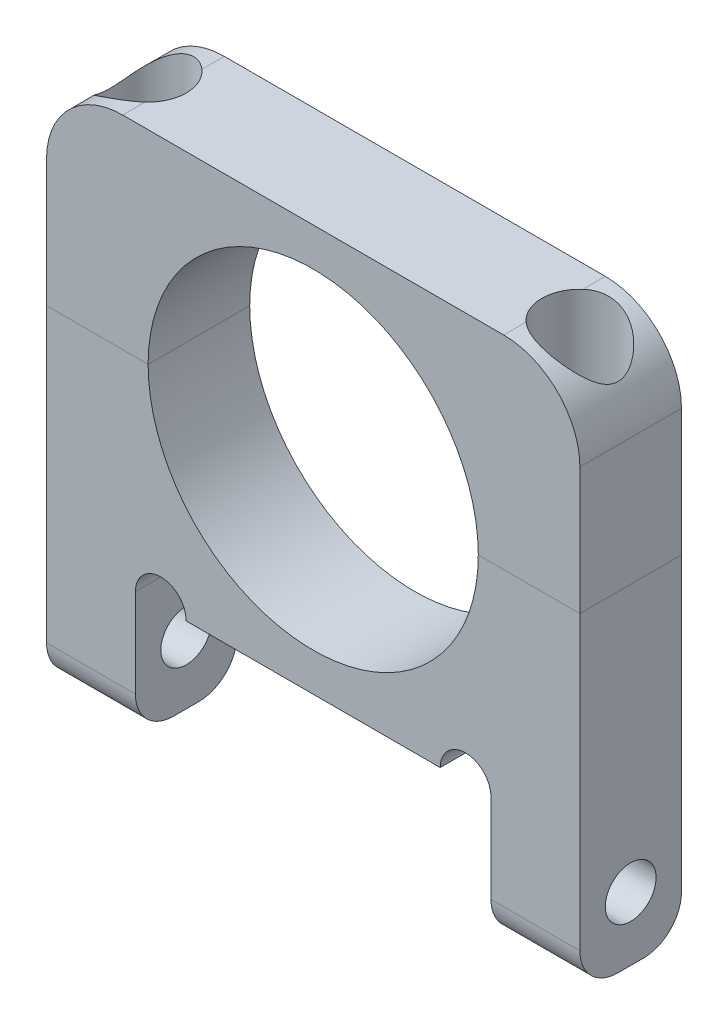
ISO-10303-21;
HEADER;
FILE_DESCRIPTION(('STEP AP214'),'2;1');
FILE_NAME('part.step','',(''),(''),'','','');
FILE_SCHEMA(('AUTOMOTIVE_DESIGN { 1 0 10303 214 1 1 1 1 }'));
ENDSEC;
DATA;
#1=APPLICATION_CONTEXT('core data for automotive mechanical design processes');
#2=APPLICATION_PROTOCOL_DEFINITION('international standard','automotive_design',2000,#1);
#3=PRODUCT_CONTEXT('',#1,'mechanical');
#4=PRODUCT('Part','Part','',(#3));
#5=PRODUCT_RELATED_PRODUCT_CATEGORY('part','',(#4));
#6=PRODUCT_DEFINITION_FORMATION('','',#4);
#7=PRODUCT_DEFINITION_CONTEXT('part definition',#1,'design');
#8=PRODUCT_DEFINITION('design','',#6,#7);
#9=PRODUCT_DEFINITION_SHAPE('','',#8);
#10=(LENGTH_UNIT() NAMED_UNIT(*) SI_UNIT(.MILLI.,.METRE.));
#11=(NAMED_UNIT(*) PLANE_ANGLE_UNIT() SI_UNIT($,.RADIAN.));
#12=(NAMED_UNIT(*) SI_UNIT($,.STERADIAN.) SOLID_ANGLE_UNIT());
#13=UNCERTAINTY_MEASURE_WITH_UNIT(LENGTH_MEASURE(1.E-05),#10,'distance_accuracy_value','');
#14=(GEOMETRIC_REPRESENTATION_CONTEXT(3) GLOBAL_UNCERTAINTY_ASSIGNED_CONTEXT((#13)) GLOBAL_UNIT_ASSIGNED_CONTEXT((#10,
#11,#12)) REPRESENTATION_CONTEXT('',''));
#15=CARTESIAN_POINT('',(0.,0.,0.));
#16=DIRECTION('',(0.,0.,1.));
#17=DIRECTION('',(1.,0.,0.));
#18=AXIS2_PLACEMENT_3D('',#15,#16,#17);
#19=CARTESIAN_POINT('',(-33.3375,0.,6.35));
#20=DIRECTION('',(0.,-1.,0.));
#21=DIRECTION('',(0.,0.,-1.));
#22=AXIS2_PLACEMENT_3D('',#19,#20,#21);
#23=PLANE('',#22);
#24=DIRECTION('',(-1.,0.,0.));
#25=VECTOR('',#24,1.);
#26=CARTESIAN_POINT('',(-33.3375,0.,-6.35));
#27=LINE('',#26,#25);
#28=CARTESIAN_POINT('',(-20.6375,0.,-6.35));
#29=VERTEX_POINT('',#28);
#30=CARTESIAN_POINT('',(-33.3375,0.,-6.35));
#31=VERTEX_POINT('',#30);
#32=EDGE_CURVE('E316',#29,#31,#27,.T.);
#33=ORIENTED_EDGE('',*,*,#32,.T.);
#34=DIRECTION('',(0.,0.,-1.));
#35=VECTOR('',#34,1.);
#36=CARTESIAN_POINT('',(-33.3375,0.,6.35));
#37=LINE('',#36,#35);
#38=CARTESIAN_POINT('',(-33.3375,0.,6.35));
#39=VERTEX_POINT('',#38);
#40=EDGE_CURVE('E178',#39,#31,#37,.T.);
#41=ORIENTED_EDGE('',*,*,#40,.F.);
#42=DIRECTION('',(-1.,0.,0.));
#43=VECTOR('',#42,1.);
#44=CARTESIAN_POINT('',(-33.3375,0.,6.35));
#45=LINE('',#44,#43);
#46=CARTESIAN_POINT('',(-20.6375,0.,6.35));
#47=VERTEX_POINT('',#46);
#48=EDGE_CURVE('E171',#47,#39,#45,.T.);
#49=ORIENTED_EDGE('',*,*,#48,.F.);
#50=DIRECTION('',(0.,0.,-1.));
#51=VECTOR('',#50,1.);
#52=CARTESIAN_POINT('',(-20.6375,0.,6.35));
#53=LINE('',#52,#51);
#54=EDGE_CURVE('E175',#47,#29,#53,.T.);
#55=ORIENTED_EDGE('',*,*,#54,.T.);
#56=EDGE_LOOP('',(#33,#41,#49,#55));
#57=FACE_BOUND('',#56,.T.);
#58=CARTESIAN_POINT('',(-26.9875,0.,0.));
#59=DIRECTION('',(0.,-1.,0.));
#60=DIRECTION('',(0.,0.,-1.));
#61=AXIS2_PLACEMENT_3D('',#58,#59,#60);
#62=CIRCLE('',#61,3.175);
#63=CARTESIAN_POINT('',(-26.9875,0.,-3.175));
#64=VERTEX_POINT('',#63);
#65=EDGE_CURVE('E210',#64,#64,#62,.F.);
#66=ORIENTED_EDGE('',*,*,#65,.F.);
#67=EDGE_LOOP('',(#66));
#68=FACE_BOUND('',#67,.T.);
#69=ADVANCED_FACE('F57',(#57,#68),#23,.F.);
#70=CARTESIAN_POINT('',(20.6375,0.,6.35));
#71=DIRECTION('',(0.,-1.,0.));
#72=DIRECTION('',(0.,0.,-1.));
#73=AXIS2_PLACEMENT_3D('',#70,#71,#72);
#74=PLANE('',#73);
#75=DIRECTION('',(-1.,0.,0.));
#76=VECTOR('',#75,1.);
#77=CARTESIAN_POINT('',(20.6375,0.,-6.35));
#78=LINE('',#77,#76);
#79=CARTESIAN_POINT('',(33.3375,0.,-6.35));
#80=VERTEX_POINT('',#79);
#81=CARTESIAN_POINT('',(20.6375,0.,-6.35));
#82=VERTEX_POINT('',#81);
#83=EDGE_CURVE('E193',#80,#82,#78,.T.);
#84=ORIENTED_EDGE('',*,*,#83,.T.);
#85=DIRECTION('',(0.,0.,-1.));
#86=VECTOR('',#85,1.);
#87=CARTESIAN_POINT('',(20.6375,0.,6.35));
#88=LINE('',#87,#86);
#89=CARTESIAN_POINT('',(20.6375,0.,6.35));
#90=VERTEX_POINT('',#89);
#91=EDGE_CURVE('E280',#90,#82,#88,.T.);
#92=ORIENTED_EDGE('',*,*,#91,.F.);
#93=DIRECTION('',(-1.,0.,0.));
#94=VECTOR('',#93,1.);
#95=CARTESIAN_POINT('',(20.6375,0.,6.35));
#96=LINE('',#95,#94);
#97=CARTESIAN_POINT('',(33.3375,0.,6.35));
#98=VERTEX_POINT('',#97);
#99=EDGE_CURVE('E189',#98,#90,#96,.T.);
#100=ORIENTED_EDGE('',*,*,#99,.F.);
#101=DIRECTION('',(0.,0.,-1.));
#102=VECTOR('',#101,1.);
#103=CARTESIAN_POINT('',(33.3375,0.,6.35));
#104=LINE('',#103,#102);
#105=EDGE_CURVE('E276',#98,#80,#104,.T.);
#106=ORIENTED_EDGE('',*,*,#105,.T.);
#107=EDGE_LOOP('',(#84,#92,#100,#106));
#108=FACE_BOUND('',#107,.T.);
#109=CARTESIAN_POINT('',(26.9875,0.,0.));
#110=DIRECTION('',(0.,-1.,0.));
#111=DIRECTION('',(0.,0.,-1.));
#112=AXIS2_PLACEMENT_3D('',#109,#110,#111);
#113=CIRCLE('',#112,3.175);
#114=CARTESIAN_POINT('',(26.9875,0.,-3.175));
#115=VERTEX_POINT('',#114);
#116=EDGE_CURVE('E207',#115,#115,#113,.F.);
#117=ORIENTED_EDGE('',*,*,#116,.F.);
#118=EDGE_LOOP('',(#117));
#119=FACE_BOUND('',#118,.T.);
#120=ADVANCED_FACE('F360',(#108,#119),#74,.F.);
#121=CARTESIAN_POINT('',(0.,0.,6.35));
#122=DIRECTION('',(0.,0.,-1.));
#123=DIRECTION('',(-1.,0.,0.));
#124=AXIS2_PLACEMENT_3D('',#121,#122,#123);
#125=CYLINDRICAL_SURFACE('',#124,20.6375);
#126=CARTESIAN_POINT('',(0.,0.,-6.35));
#127=DIRECTION('',(0.,0.,-1.));
#128=DIRECTION('',(1.,0.,0.));
#129=AXIS2_PLACEMENT_3D('',#126,#127,#128);
#130=CIRCLE('',#129,20.6375);
#131=EDGE_CURVE('E197',#82,#29,#130,.T.);
#132=ORIENTED_EDGE('',*,*,#131,.T.);
#133=ORIENTED_EDGE('',*,*,#54,.F.);
#134=CARTESIAN_POINT('',(0.,0.,6.35));
#135=DIRECTION('',(0.,0.,-1.));
#136=DIRECTION('',(1.,0.,0.));
#137=AXIS2_PLACEMENT_3D('',#134,#135,#136);
#138=CIRCLE('',#137,20.6375);
#139=EDGE_CURVE('E183',#90,#47,#138,.T.);
#140=ORIENTED_EDGE('',*,*,#139,.F.);
#141=ORIENTED_EDGE('',*,*,#91,.T.);
#142=EDGE_LOOP('',(#132,#133,#140,#141));
#143=FACE_BOUND('',#142,.T.);
#144=ADVANCED_FACE('F195',(#143),#125,.F.);
#145=CARTESIAN_POINT('',(-33.3375,-41.275,6.35));
#146=DIRECTION('',(1.,0.,0.));
#147=DIRECTION('',(0.,0.,-1.));
#148=AXIS2_PLACEMENT_3D('',#145,#146,#147);
#149=PLANE('',#148);
#150=CARTESIAN_POINT('',(-33.3375,-33.3248,0.));
#151=DIRECTION('',(1.,0.,0.));
#152=DIRECTION('',(0.,0.,-1.));
#153=AXIS2_PLACEMENT_3D('',#150,#151,#152);
#154=CIRCLE('',#153,3.175);
#155=CARTESIAN_POINT('',(-33.3375,-33.3248,-3.175));
#156=VERTEX_POINT('',#155);
#157=EDGE_CURVE('E379',#156,#156,#154,.T.);
#158=ORIENTED_EDGE('',*,*,#157,.T.);
#159=EDGE_LOOP('',(#158));
#160=FACE_BOUND('',#159,.T.);
#161=DIRECTION('',(0.,0.,-1.));
#162=VECTOR('',#161,1.);
#163=CARTESIAN_POINT('',(-33.3375,-41.275,6.35));
#164=LINE('',#163,#162);
#165=CARTESIAN_POINT('',(-33.3375,-41.275,1.5748));
#166=VERTEX_POINT('',#165);
#167=CARTESIAN_POINT('',(-33.3375,-41.275,-1.5748));
#168=VERTEX_POINT('',#167);
#169=EDGE_CURVE('E203',#166,#168,#164,.T.);
#170=ORIENTED_EDGE('',*,*,#169,.F.);
#171=CARTESIAN_POINT('',(-33.3375,-36.4998,1.5748));
#172=DIRECTION('',(1.,0.,0.));
#173=DIRECTION('',(0.,0.,-1.));
#174=AXIS2_PLACEMENT_3D('',#171,#172,#173);
#175=CIRCLE('',#174,4.7752);
#176=CARTESIAN_POINT('',(-33.3375,-36.4998,6.35));
#177=VERTEX_POINT('',#176);
#178=EDGE_CURVE('E243',#166,#177,#175,.F.);
#179=ORIENTED_EDGE('',*,*,#178,.T.);
#180=DIRECTION('',(0.,-1.,0.));
#181=VECTOR('',#180,1.);
#182=CARTESIAN_POINT('',(-33.3375,-41.275,6.35));
#183=LINE('',#182,#181);
#184=EDGE_CURVE('E182',#39,#177,#183,.T.);
#185=ORIENTED_EDGE('',*,*,#184,.F.);
#186=ORIENTED_EDGE('',*,*,#40,.T.);
#187=DIRECTION('',(0.,-1.,0.));
#188=VECTOR('',#187,1.);
#189=CARTESIAN_POINT('',(-33.3375,-41.275,-6.35));
#190=LINE('',#189,#188);
#191=CARTESIAN_POINT('',(-33.3375,-36.4998,-6.35));
#192=VERTEX_POINT('',#191);
#193=EDGE_CURVE('E312',#31,#192,#190,.T.);
#194=ORIENTED_EDGE('',*,*,#193,.T.);
#195=CARTESIAN_POINT('',(-33.3375,-36.4998,-1.5748));
#196=DIRECTION('',(1.,0.,0.));
#197=DIRECTION('',(0.,0.,-1.));
#198=AXIS2_PLACEMENT_3D('',#195,#196,#197);
#199=CIRCLE('',#198,4.7752);
#200=EDGE_CURVE('E77',#192,#168,#199,.F.);
#201=ORIENTED_EDGE('',*,*,#200,.T.);
#202=EDGE_LOOP('',(#170,#179,#185,#186,#194,#201));
#203=FACE_BOUND('',#202,.T.);
#204=ADVANCED_FACE('F329',(#160,#203),#149,.F.);
#205=CARTESIAN_POINT('',(-22.225,-41.275,6.35));
#206=DIRECTION('',(0.,1.,0.));
#207=DIRECTION('',(0.,0.,1.));
#208=AXIS2_PLACEMENT_3D('',#205,#206,#207);
#209=PLANE('',#208);
#210=DIRECTION('',(0.,0.,-1.));
#211=VECTOR('',#210,1.);
#212=CARTESIAN_POINT('',(-22.225,-41.275,6.35));
#213=LINE('',#212,#211);
#214=CARTESIAN_POINT('',(-22.225,-41.275,1.5748));
#215=VERTEX_POINT('',#214);
#216=CARTESIAN_POINT('',(-22.225,-41.275,-1.5748));
#217=VERTEX_POINT('',#216);
#218=EDGE_CURVE('E294',#215,#217,#213,.T.);
#219=ORIENTED_EDGE('',*,*,#218,.F.);
#220=DIRECTION('',(1.,0.,0.));
#221=VECTOR('',#220,1.);
#222=CARTESIAN_POINT('',(-33.3375,-41.275,1.5748));
#223=LINE('',#222,#221);
#224=EDGE_CURVE('E240',#215,#166,#223,.F.);
#225=ORIENTED_EDGE('',*,*,#224,.T.);
#226=ORIENTED_EDGE('',*,*,#169,.T.);
#227=DIRECTION('',(1.,0.,0.));
#228=VECTOR('',#227,1.);
#229=CARTESIAN_POINT('',(-22.225,-41.275,-1.5748));
#230=LINE('',#229,#228);
#231=EDGE_CURVE('E237',#168,#217,#230,.T.);
#232=ORIENTED_EDGE('',*,*,#231,.T.);
#233=EDGE_LOOP('',(#219,#225,#226,#232));
#234=FACE_BOUND('',#233,.T.);
#235=ADVANCED_FACE('F299',(#234),#209,.F.);
#236=CARTESIAN_POINT('',(-22.225,-25.4,6.35));
#237=DIRECTION('',(-1.,0.,0.));
#238=DIRECTION('',(0.,0.,1.));
#239=AXIS2_PLACEMENT_3D('',#236,#237,#238);
#240=PLANE('',#239);
#241=CARTESIAN_POINT('',(-22.225,-33.3248,0.));
#242=DIRECTION('',(-1.,0.,0.));
#243=DIRECTION('',(0.,0.,1.));
#244=AXIS2_PLACEMENT_3D('',#241,#242,#243);
#245=CIRCLE('',#244,3.175);
#246=CARTESIAN_POINT('',(-22.225,-33.3248,3.175));
#247=VERTEX_POINT('',#246);
#248=EDGE_CURVE('E382',#247,#247,#245,.T.);
#249=ORIENTED_EDGE('',*,*,#248,.T.);
#250=EDGE_LOOP('',(#249));
#251=FACE_BOUND('',#250,.T.);
#252=DIRECTION('',(0.,1.,0.));
#253=VECTOR('',#252,1.);
#254=CARTESIAN_POINT('',(-22.225,-25.4,6.35));
#255=LINE('',#254,#253);
#256=CARTESIAN_POINT('',(-22.225,-36.4998,6.35));
#257=VERTEX_POINT('',#256);
#258=CARTESIAN_POINT('',(-22.225,-25.4,6.35));
#259=VERTEX_POINT('',#258);
#260=EDGE_CURVE('E331',#257,#259,#255,.T.);
#261=ORIENTED_EDGE('',*,*,#260,.F.);
#262=CARTESIAN_POINT('',(-22.225,-36.4998,1.5748));
#263=DIRECTION('',(-1.,0.,0.));
#264=DIRECTION('',(0.,0.,1.));
#265=AXIS2_PLACEMENT_3D('',#262,#263,#264);
#266=CIRCLE('',#265,4.7752);
#267=EDGE_CURVE('E235',#257,#215,#266,.F.);
#268=ORIENTED_EDGE('',*,*,#267,.T.);
#269=ORIENTED_EDGE('',*,*,#218,.T.);
#270=CARTESIAN_POINT('',(-22.225,-36.4998,-1.5748));
#271=DIRECTION('',(-1.,0.,0.));
#272=DIRECTION('',(0.,0.,1.));
#273=AXIS2_PLACEMENT_3D('',#270,#271,#272);
#274=CIRCLE('',#273,4.7752);
#275=CARTESIAN_POINT('',(-22.225,-36.4998,-6.35));
#276=VERTEX_POINT('',#275);
#277=EDGE_CURVE('E233',#217,#276,#274,.F.);
#278=ORIENTED_EDGE('',*,*,#277,.T.);
#279=DIRECTION('',(0.,1.,0.));
#280=VECTOR('',#279,1.);
#281=CARTESIAN_POINT('',(-22.225,-25.4,-6.35));
#282=LINE('',#281,#280);
#283=CARTESIAN_POINT('',(-22.225,-25.4,-6.35));
#284=VERTEX_POINT('',#283);
#285=EDGE_CURVE('E308',#276,#284,#282,.T.);
#286=ORIENTED_EDGE('',*,*,#285,.T.);
#287=DIRECTION('',(0.,0.,-1.));
#288=VECTOR('',#287,1.);
#289=CARTESIAN_POINT('',(-22.225,-25.4,6.35));
#290=LINE('',#289,#288);
#291=EDGE_CURVE('E291',#259,#284,#290,.T.);
#292=ORIENTED_EDGE('',*,*,#291,.F.);
#293=EDGE_LOOP('',(#261,#268,#269,#278,#286,#292));
#294=FACE_BOUND('',#293,.T.);
#295=ADVANCED_FACE('F306',(#251,#294),#240,.F.);
#296=CARTESIAN_POINT('',(-19.05,-25.4,6.35));
#297=DIRECTION('',(0.,0.,-1.));
#298=DIRECTION('',(-1.,0.,0.));
#299=AXIS2_PLACEMENT_3D('',#296,#297,#298);
#300=CYLINDRICAL_SURFACE('',#299,3.175);
#301=CARTESIAN_POINT('',(-19.05,-25.4,-6.35));
#302=DIRECTION('',(0.,0.,-1.));
#303=DIRECTION('',(1.,0.,0.));
#304=AXIS2_PLACEMENT_3D('',#301,#302,#303);
#305=CIRCLE('',#304,3.175);
#306=CARTESIAN_POINT('',(-15.875,-25.4,-6.35));
#307=VERTEX_POINT('',#306);
#308=EDGE_CURVE('E311',#284,#307,#305,.T.);
#309=ORIENTED_EDGE('',*,*,#308,.T.);
#310=DIRECTION('',(0.,0.,-1.));
#311=VECTOR('',#310,1.);
#312=CARTESIAN_POINT('',(-15.875,-25.4,6.35));
#313=LINE('',#312,#311);
#314=CARTESIAN_POINT('',(-15.875,-25.4,6.35));
#315=VERTEX_POINT('',#314);
#316=EDGE_CURVE('E288',#315,#307,#313,.T.);
#317=ORIENTED_EDGE('',*,*,#316,.F.);
#318=CARTESIAN_POINT('',(-19.05,-25.4,6.35));
#319=DIRECTION('',(0.,0.,-1.));
#320=DIRECTION('',(1.,0.,0.));
#321=AXIS2_PLACEMENT_3D('',#318,#319,#320);
#322=CIRCLE('',#321,3.175);
#323=EDGE_CURVE('E333',#259,#315,#322,.T.);
#324=ORIENTED_EDGE('',*,*,#323,.F.);
#325=ORIENTED_EDGE('',*,*,#291,.T.);
#326=EDGE_LOOP('',(#309,#317,#324,#325));
#327=FACE_BOUND('',#326,.T.);
#328=ADVANCED_FACE('F432',(#327),#300,.F.);
#329=CARTESIAN_POINT('',(15.875,-25.4,6.35));
#330=DIRECTION('',(0.,1.,0.));
#331=DIRECTION('',(-1.,0.,0.));
#332=AXIS2_PLACEMENT_3D('',#329,#330,#331);
#333=PLANE('',#332);
#334=DIRECTION('',(1.,0.,0.));
#335=VECTOR('',#334,1.);
#336=CARTESIAN_POINT('',(15.875,-25.4,-6.35));
#337=LINE('',#336,#335);
#338=CARTESIAN_POINT('',(15.875,-25.4,-6.35));
#339=VERTEX_POINT('',#338);
#340=EDGE_CURVE('E314',#307,#339,#337,.T.);
#341=ORIENTED_EDGE('',*,*,#340,.T.);
#342=DIRECTION('',(0.,0.,-1.));
#343=VECTOR('',#342,1.);
#344=CARTESIAN_POINT('',(15.875,-25.4,6.35));
#345=LINE('',#344,#343);
#346=CARTESIAN_POINT('',(15.875,-25.4,6.35));
#347=VERTEX_POINT('',#346);
#348=EDGE_CURVE('E285',#347,#339,#345,.T.);
#349=ORIENTED_EDGE('',*,*,#348,.F.);
#350=DIRECTION('',(1.,0.,0.));
#351=VECTOR('',#350,1.);
#352=CARTESIAN_POINT('',(15.875,-25.4,6.35));
#353=LINE('',#352,#351);
#354=EDGE_CURVE('E337',#315,#347,#353,.T.);
#355=ORIENTED_EDGE('',*,*,#354,.F.);
#356=ORIENTED_EDGE('',*,*,#316,.T.);
#357=EDGE_LOOP('',(#341,#349,#355,#356));
#358=FACE_BOUND('',#357,.T.);
#359=ADVANCED_FACE('F428',(#358),#333,.F.);
#360=CARTESIAN_POINT('',(19.05,-25.4,6.35));
#361=DIRECTION('',(0.,0.,-1.));
#362=DIRECTION('',(-1.,0.,0.));
#363=AXIS2_PLACEMENT_3D('',#360,#361,#362);
#364=CYLINDRICAL_SURFACE('',#363,3.175);
#365=CARTESIAN_POINT('',(19.05,-25.4,-6.35));
#366=DIRECTION('',(0.,0.,-1.));
#367=DIRECTION('',(1.,0.,0.));
#368=AXIS2_PLACEMENT_3D('',#365,#366,#367);
#369=CIRCLE('',#368,3.175);
#370=CARTESIAN_POINT('',(22.225,-25.4,-6.35));
#371=VERTEX_POINT('',#370);
#372=EDGE_CURVE('E263',#339,#371,#369,.T.);
#373=ORIENTED_EDGE('',*,*,#372,.T.);
#374=DIRECTION('',(0.,0.,-1.));
#375=VECTOR('',#374,1.);
#376=CARTESIAN_POINT('',(22.225,-25.4,6.35));
#377=LINE('',#376,#375);
#378=CARTESIAN_POINT('',(22.225,-25.4,6.35));
#379=VERTEX_POINT('',#378);
#380=EDGE_CURVE('E262',#379,#371,#377,.T.);
#381=ORIENTED_EDGE('',*,*,#380,.F.);
#382=CARTESIAN_POINT('',(19.05,-25.4,6.35));
#383=DIRECTION('',(0.,0.,-1.));
#384=DIRECTION('',(1.,0.,0.));
#385=AXIS2_PLACEMENT_3D('',#382,#383,#384);
#386=CIRCLE('',#385,3.175);
#387=EDGE_CURVE('E339',#347,#379,#386,.T.);
#388=ORIENTED_EDGE('',*,*,#387,.F.);
#389=ORIENTED_EDGE('',*,*,#348,.T.);
#390=EDGE_LOOP('',(#373,#381,#388,#389));
#391=FACE_BOUND('',#390,.T.);
#392=ADVANCED_FACE('F424',(#391),#364,.F.);
#393=CARTESIAN_POINT('',(22.225,-41.275,6.35));
#394=DIRECTION('',(1.,0.,0.));
#395=DIRECTION('',(0.,0.,-1.));
#396=AXIS2_PLACEMENT_3D('',#393,#394,#395);
#397=PLANE('',#396);
#398=CARTESIAN_POINT('',(22.225,-33.3248,0.));
#399=DIRECTION('',(1.,0.,0.));
#400=DIRECTION('',(0.,0.,-1.));
#401=AXIS2_PLACEMENT_3D('',#398,#399,#400);
#402=CIRCLE('',#401,3.175);
#403=CARTESIAN_POINT('',(22.225,-33.3248,-3.175));
#404=VERTEX_POINT('',#403);
#405=EDGE_CURVE('E216',#404,#404,#402,.T.);
#406=ORIENTED_EDGE('',*,*,#405,.T.);
#407=EDGE_LOOP('',(#406));
#408=FACE_BOUND('',#407,.T.);
#409=DIRECTION('',(0.,0.,-1.));
#410=VECTOR('',#409,1.);
#411=CARTESIAN_POINT('',(22.225,-41.275,6.35));
#412=LINE('',#411,#410);
#413=CARTESIAN_POINT('',(22.225,-41.275,1.5748));
#414=VERTEX_POINT('',#413);
#415=CARTESIAN_POINT('',(22.225,-41.275,-1.5748));
#416=VERTEX_POINT('',#415);
#417=EDGE_CURVE('E272',#414,#416,#412,.T.);
#418=ORIENTED_EDGE('',*,*,#417,.F.);
#419=CARTESIAN_POINT('',(22.225,-36.4998,1.5748));
#420=DIRECTION('',(1.,0.,0.));
#421=DIRECTION('',(0.,0.,-1.));
#422=AXIS2_PLACEMENT_3D('',#419,#420,#421);
#423=CIRCLE('',#422,4.7752);
#424=CARTESIAN_POINT('',(22.225,-36.4998,6.35));
#425=VERTEX_POINT('',#424);
#426=EDGE_CURVE('E231',#414,#425,#423,.F.);
#427=ORIENTED_EDGE('',*,*,#426,.T.);
#428=DIRECTION('',(0.,-1.,0.));
#429=VECTOR('',#428,1.);
#430=CARTESIAN_POINT('',(22.225,-41.275,6.35));
#431=LINE('',#430,#429);
#432=EDGE_CURVE('E325',#379,#425,#431,.T.);
#433=ORIENTED_EDGE('',*,*,#432,.F.);
#434=ORIENTED_EDGE('',*,*,#380,.T.);
#435=DIRECTION('',(0.,-1.,0.));
#436=VECTOR('',#435,1.);
#437=CARTESIAN_POINT('',(22.225,-41.275,-6.35));
#438=LINE('',#437,#436);
#439=CARTESIAN_POINT('',(22.225,-36.4998,-6.35));
#440=VERTEX_POINT('',#439);
#441=EDGE_CURVE('E250',#371,#440,#438,.T.);
#442=ORIENTED_EDGE('',*,*,#441,.T.);
#443=CARTESIAN_POINT('',(22.225,-36.4998,-1.5748));
#444=DIRECTION('',(1.,0.,0.));
#445=DIRECTION('',(0.,0.,-1.));
#446=AXIS2_PLACEMENT_3D('',#443,#444,#445);
#447=CIRCLE('',#446,4.7752);
#448=EDGE_CURVE('E229',#440,#416,#447,.F.);
#449=ORIENTED_EDGE('',*,*,#448,.T.);
#450=EDGE_LOOP('',(#418,#427,#433,#434,#442,#449));
#451=FACE_BOUND('',#450,.T.);
#452=ADVANCED_FACE('F258',(#408,#451),#397,.F.);
#453=CARTESIAN_POINT('',(33.3375,-41.275,6.35));
#454=DIRECTION('',(0.,1.,0.));
#455=DIRECTION('',(0.,0.,1.));
#456=AXIS2_PLACEMENT_3D('',#453,#454,#455);
#457=PLANE('',#456);
#458=DIRECTION('',(0.,0.,-1.));
#459=VECTOR('',#458,1.);
#460=CARTESIAN_POINT('',(33.3375,-41.275,6.35));
#461=LINE('',#460,#459);
#462=CARTESIAN_POINT('',(33.3375,-41.275,1.5748));
#463=VERTEX_POINT('',#462);
#464=CARTESIAN_POINT('',(33.3375,-41.275,-1.5748));
#465=VERTEX_POINT('',#464);
#466=EDGE_CURVE('E270',#463,#465,#461,.T.);
#467=ORIENTED_EDGE('',*,*,#466,.F.);
#468=DIRECTION('',(1.,0.,0.));
#469=VECTOR('',#468,1.);
#470=CARTESIAN_POINT('',(22.225,-41.275,1.5748));
#471=LINE('',#470,#469);
#472=EDGE_CURVE('E227',#463,#414,#471,.F.);
#473=ORIENTED_EDGE('',*,*,#472,.T.);
#474=ORIENTED_EDGE('',*,*,#417,.T.);
#475=DIRECTION('',(1.,0.,0.));
#476=VECTOR('',#475,1.);
#477=CARTESIAN_POINT('',(33.3375,-41.275,-1.5748));
#478=LINE('',#477,#476);
#479=EDGE_CURVE('E224',#416,#465,#478,.T.);
#480=ORIENTED_EDGE('',*,*,#479,.T.);
#481=EDGE_LOOP('',(#467,#473,#474,#480));
#482=FACE_BOUND('',#481,.T.);
#483=ADVANCED_FACE('F269',(#482),#457,.F.);
#484=CARTESIAN_POINT('',(33.3375,0.,6.35));
#485=DIRECTION('',(-1.,0.,0.));
#486=DIRECTION('',(0.,0.,1.));
#487=AXIS2_PLACEMENT_3D('',#484,#485,#486);
#488=PLANE('',#487);
#489=CARTESIAN_POINT('',(33.3375,-33.3248,0.));
#490=DIRECTION('',(-1.,0.,0.));
#491=DIRECTION('',(0.,0.,1.));
#492=AXIS2_PLACEMENT_3D('',#489,#490,#491);
#493=CIRCLE('',#492,3.175);
#494=CARTESIAN_POINT('',(33.3375,-33.3248,3.175));
#495=VERTEX_POINT('',#494);
#496=EDGE_CURVE('E214',#495,#495,#493,.T.);
#497=ORIENTED_EDGE('',*,*,#496,.T.);
#498=EDGE_LOOP('',(#497));
#499=FACE_BOUND('',#498,.T.);
#500=DIRECTION('',(0.,1.,0.));
#501=VECTOR('',#500,1.);
#502=CARTESIAN_POINT('',(33.3375,0.,6.35));
#503=LINE('',#502,#501);
#504=CARTESIAN_POINT('',(33.3375,-36.4998,6.35));
#505=VERTEX_POINT('',#504);
#506=EDGE_CURVE('E323',#505,#98,#503,.T.);
#507=ORIENTED_EDGE('',*,*,#506,.F.);
#508=CARTESIAN_POINT('',(33.3375,-36.4998,1.5748));
#509=DIRECTION('',(-1.,0.,0.));
#510=DIRECTION('',(0.,0.,1.));
#511=AXIS2_PLACEMENT_3D('',#508,#509,#510);
#512=CIRCLE('',#511,4.7752);
#513=EDGE_CURVE('E222',#505,#463,#512,.F.);
#514=ORIENTED_EDGE('',*,*,#513,.T.);
#515=ORIENTED_EDGE('',*,*,#466,.T.);
#516=CARTESIAN_POINT('',(33.3375,-36.4998,-1.5748));
#517=DIRECTION('',(-1.,0.,0.));
#518=DIRECTION('',(0.,0.,1.));
#519=AXIS2_PLACEMENT_3D('',#516,#517,#518);
#520=CIRCLE('',#519,4.7752);
#521=CARTESIAN_POINT('',(33.3375,-36.4998,-6.35));
#522=VERTEX_POINT('',#521);
#523=EDGE_CURVE('E220',#465,#522,#520,.F.);
#524=ORIENTED_EDGE('',*,*,#523,.T.);
#525=DIRECTION('',(0.,1.,0.));
#526=VECTOR('',#525,1.);
#527=CARTESIAN_POINT('',(33.3375,0.,-6.35));
#528=LINE('',#527,#526);
#529=EDGE_CURVE('E252',#522,#80,#528,.T.);
#530=ORIENTED_EDGE('',*,*,#529,.T.);
#531=ORIENTED_EDGE('',*,*,#105,.F.);
#532=EDGE_LOOP('',(#507,#514,#515,#524,#530,#531));
#533=FACE_BOUND('',#532,.T.);
#534=ADVANCED_FACE('F275',(#499,#533),#488,.F.);
#535=CARTESIAN_POINT('',(0.,0.,6.35));
#536=DIRECTION('',(0.,0.,1.));
#537=DIRECTION('',(1.,0.,0.));
#538=AXIS2_PLACEMENT_3D('',#535,#536,#537);
#539=PLANE('',#538);
#540=ORIENTED_EDGE('',*,*,#432,.T.);
#541=DIRECTION('',(1.,0.,0.));
#542=VECTOR('',#541,1.);
#543=CARTESIAN_POINT('',(33.3375,-36.4998,6.35));
#544=LINE('',#543,#542);
#545=EDGE_CURVE('E201',#425,#505,#544,.T.);
#546=ORIENTED_EDGE('',*,*,#545,.T.);
#547=ORIENTED_EDGE('',*,*,#506,.T.);
#548=ORIENTED_EDGE('',*,*,#99,.T.);
#549=ORIENTED_EDGE('',*,*,#139,.T.);
#550=ORIENTED_EDGE('',*,*,#48,.T.);
#551=ORIENTED_EDGE('',*,*,#184,.T.);
#552=DIRECTION('',(1.,0.,0.));
#553=VECTOR('',#552,1.);
#554=CARTESIAN_POINT('',(-22.225,-36.4998,6.35));
#555=LINE('',#554,#553);
#556=EDGE_CURVE('E198',#177,#257,#555,.T.);
#557=ORIENTED_EDGE('',*,*,#556,.T.);
#558=ORIENTED_EDGE('',*,*,#260,.T.);
#559=ORIENTED_EDGE('',*,*,#323,.T.);
#560=ORIENTED_EDGE('',*,*,#354,.T.);
#561=ORIENTED_EDGE('',*,*,#387,.T.);
#562=EDGE_LOOP('',(#540,#546,#547,#548,#549,#550,#551,#557,#558,#559,#560,#561));
#563=FACE_BOUND('',#562,.T.);
#564=ADVANCED_FACE('F187',(#563),#539,.T.);
#565=CARTESIAN_POINT('',(0.,0.,-6.35));
#566=DIRECTION('',(0.,0.,1.));
#567=DIRECTION('',(1.,0.,0.));
#568=AXIS2_PLACEMENT_3D('',#565,#566,#567);
#569=PLANE('',#568);
#570=ORIENTED_EDGE('',*,*,#285,.F.);
#571=DIRECTION('',(1.,0.,0.));
#572=VECTOR('',#571,1.);
#573=CARTESIAN_POINT('',(0.,-36.4998,-6.35));
#574=LINE('',#573,#572);
#575=EDGE_CURVE('E14',#276,#192,#574,.F.);
#576=ORIENTED_EDGE('',*,*,#575,.T.);
#577=ORIENTED_EDGE('',*,*,#193,.F.);
#578=ORIENTED_EDGE('',*,*,#32,.F.);
#579=ORIENTED_EDGE('',*,*,#131,.F.);
#580=ORIENTED_EDGE('',*,*,#83,.F.);
#581=ORIENTED_EDGE('',*,*,#529,.F.);
#582=DIRECTION('',(1.,0.,0.));
#583=VECTOR('',#582,1.);
#584=CARTESIAN_POINT('',(0.,-36.4998,-6.35));
#585=LINE('',#584,#583);
#586=EDGE_CURVE('E65',#522,#440,#585,.F.);
#587=ORIENTED_EDGE('',*,*,#586,.T.);
#588=ORIENTED_EDGE('',*,*,#441,.F.);
#589=ORIENTED_EDGE('',*,*,#372,.F.);
#590=ORIENTED_EDGE('',*,*,#340,.F.);
#591=ORIENTED_EDGE('',*,*,#308,.F.);
#592=EDGE_LOOP('',(#570,#576,#577,#578,#579,#580,#581,#587,#588,#589,#590,#591));
#593=FACE_BOUND('',#592,.T.);
#594=ADVANCED_FACE('F248',(#593),#569,.F.);
#595=CARTESIAN_POINT('',(26.9875,30.48,0.));
#596=DIRECTION('',(0.,-1.,0.));
#597=DIRECTION('',(0.,0.,-1.));
#598=AXIS2_PLACEMENT_3D('',#595,#596,#597);
#599=CYLINDRICAL_SURFACE('',#598,3.175);
#600=CARTESIAN_POINT('',(26.9875,-15.24,0.));
#601=DIRECTION('',(0.,1.,0.));
#602=DIRECTION('',(0.,0.,1.));
#603=AXIS2_PLACEMENT_3D('',#600,#601,#602);
#604=CIRCLE('',#603,3.175);
#605=CARTESIAN_POINT('',(26.9875,-15.24,-3.175));
#606=VERTEX_POINT('',#605);
#607=EDGE_CURVE('E381',#606,#606,#604,.T.);
#608=CARTESIAN_POINT('',(26.9875,-15.24,-3.175));
#609=CARTESIAN_POINT('',(26.9875,-15.08125,-3.175));
#610=CARTESIAN_POINT('',(26.9875,-14.9225,-3.175));
#611=CARTESIAN_POINT('',(26.9875,-14.605,-3.175));
#612=CARTESIAN_POINT('',(26.9875,-14.44625,-3.175));
#613=CARTESIAN_POINT('',(26.9875,-14.12875,-3.175));
#614=CARTESIAN_POINT('',(26.9875,-13.97,-3.175));
#615=CARTESIAN_POINT('',(26.9875,-13.6525,-3.175));
#616=CARTESIAN_POINT('',(26.9875,-13.49375,-3.175));
#617=CARTESIAN_POINT('',(26.9875,-13.17625,-3.175));
#618=CARTESIAN_POINT('',(26.9875,-13.0175,-3.175));
#619=CARTESIAN_POINT('',(26.9875,-12.7,-3.175));
#620=CARTESIAN_POINT('',(26.9875,-12.54125,-3.175));
#621=CARTESIAN_POINT('',(26.9875,-12.22375,-3.175));
#622=CARTESIAN_POINT('',(26.9875,-12.065,-3.175));
#623=CARTESIAN_POINT('',(26.9875,-11.7475,-3.175));
#624=CARTESIAN_POINT('',(26.9875,-11.58875,-3.175));
#625=CARTESIAN_POINT('',(26.9875,-11.27125,-3.175));
#626=CARTESIAN_POINT('',(26.9875,-11.1125,-3.175));
#627=CARTESIAN_POINT('',(26.9875,-10.795,-3.175));
#628=CARTESIAN_POINT('',(26.9875,-10.63625,-3.175));
#629=CARTESIAN_POINT('',(26.9875,-10.31875,-3.175));
#630=CARTESIAN_POINT('',(26.9875,-10.16,-3.175));
#631=CARTESIAN_POINT('',(26.9875,-9.8425,-3.175));
#632=CARTESIAN_POINT('',(26.9875,-9.68375,-3.175));
#633=CARTESIAN_POINT('',(26.9875,-9.36625,-3.175));
#634=CARTESIAN_POINT('',(26.9875,-9.2075,-3.175));
#635=CARTESIAN_POINT('',(26.9875,-8.89,-3.175));
#636=CARTESIAN_POINT('',(26.9875,-8.73125,-3.175));
#637=CARTESIAN_POINT('',(26.9875,-8.41375,-3.175));
#638=CARTESIAN_POINT('',(26.9875,-8.255,-3.175));
#639=CARTESIAN_POINT('',(26.9875,-7.9375,-3.175));
#640=CARTESIAN_POINT('',(26.9875,-7.77875,-3.175));
#641=CARTESIAN_POINT('',(26.9875,-7.46125,-3.175));
#642=CARTESIAN_POINT('',(26.9875,-7.3025,-3.175));
#643=CARTESIAN_POINT('',(26.9875,-6.985,-3.175));
#644=CARTESIAN_POINT('',(26.9875,-6.82625,-3.175));
#645=CARTESIAN_POINT('',(26.9875,-6.50875,-3.175));
#646=CARTESIAN_POINT('',(26.9875,-6.35,-3.175));
#647=CARTESIAN_POINT('',(26.9875,-6.0325,-3.175));
#648=CARTESIAN_POINT('',(26.9875,-5.87375,-3.175));
#649=CARTESIAN_POINT('',(26.9875,-5.55625,-3.175));
#650=CARTESIAN_POINT('',(26.9875,-5.3975,-3.175));
#651=CARTESIAN_POINT('',(26.9875,-5.08,-3.175));
#652=CARTESIAN_POINT('',(26.9875,-4.92125,-3.175));
#653=CARTESIAN_POINT('',(26.9875,-4.60375,-3.175));
#654=CARTESIAN_POINT('',(26.9875,-4.445,-3.175));
#655=CARTESIAN_POINT('',(26.9875,-4.1275,-3.175));
#656=CARTESIAN_POINT('',(26.9875,-3.96875,-3.175));
#657=CARTESIAN_POINT('',(26.9875,-3.65125,-3.175));
#658=CARTESIAN_POINT('',(26.9875,-3.49249999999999,-3.175));
#659=CARTESIAN_POINT('',(26.9875,-3.17499999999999,-3.175));
#660=CARTESIAN_POINT('',(26.9875,-3.01624999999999,-3.175));
#661=CARTESIAN_POINT('',(26.9875,-2.69875,-3.175));
#662=CARTESIAN_POINT('',(26.9875,-2.54,-3.175));
#663=CARTESIAN_POINT('',(26.9875,-2.2225,-3.175));
#664=CARTESIAN_POINT('',(26.9875,-2.06375,-3.175));
#665=CARTESIAN_POINT('',(26.9875,-1.74625,-3.175));
#666=CARTESIAN_POINT('',(26.9875,-1.5875,-3.175));
#667=CARTESIAN_POINT('',(26.9875,-1.27,-3.175));
#668=CARTESIAN_POINT('',(26.9875,-1.11125,-3.175));
#669=CARTESIAN_POINT('',(26.9875,-0.793749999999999,-3.175));
#670=CARTESIAN_POINT('',(26.9875,-0.635,-3.175));
#671=CARTESIAN_POINT('',(26.9875,-0.317500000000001,-3.175));
#672=CARTESIAN_POINT('',(26.9875,-0.15875,-3.175));
#673=CARTESIAN_POINT('',(26.9875,0.,-3.175));
#674=B_SPLINE_CURVE_WITH_KNOTS('',3,(#608,#609,#610,#611,#612,#613,#614,#615,#616,#617,#618,
#619,#620,#621,#622,#623,#624,#625,#626,#627,#628,#629,#630,#631,#632,#633,#634,#635,#636,#637,
#638,#639,#640,#641,#642,#643,#644,#645,#646,#647,#648,#649,#650,#651,#652,#653,#654,#655,#656,
#657,#658,#659,#660,#661,#662,#663,#664,#665,#666,#667,#668,#669,#670,#671,#672,#673),
.UNSPECIFIED.,.F.,.F.,(4,2,2,2,2,2,2,2,2,2,2,2,2,2,2,2,2,2,2,2,2,2,2,2,2,2,2,2,2,2,2,2,4),(0.,
0.476249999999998,0.952500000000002,1.42875,1.905,2.38125,2.8575,3.33375,3.81,4.28625,4.7625,
5.23875,5.715,6.19125,6.6675,7.14375,7.62,8.09625,8.5725,9.04875,9.52500000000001,10.00125,
10.4775,10.95375,11.43,11.90625,12.3825,12.85875,13.335,13.81125,14.2875,14.76375,15.24),.UNSPECIFIED.);
#675=EDGE_CURVE('BSEAM406',#606,#115,#674,.T.);
#676=ORIENTED_EDGE('',*,*,#607,.F.);
#677=ORIENTED_EDGE('',*,*,#116,.T.);
#678=ORIENTED_EDGE('',*,*,#675,.T.);
#679=ORIENTED_EDGE('',*,*,#675,.F.);
#680=EDGE_LOOP('',(#676,#678,#677,#679));
#681=FACE_BOUND('',#680,.T.);
#682=ADVANCED_FACE('F406',(#681),#599,.F.);
#683=CARTESIAN_POINT('',(26.9875,-15.24,0.));
#684=DIRECTION('',(0.,1.,0.));
#685=DIRECTION('',(0.,0.,1.));
#686=AXIS2_PLACEMENT_3D('',#683,#684,#685);
#687=PLANE('',#686);
#688=ORIENTED_EDGE('',*,*,#607,.T.);
#689=EDGE_LOOP('',(#688));
#690=FACE_BOUND('',#689,.T.);
#691=ADVANCED_FACE('F398',(#690),#687,.T.);
#692=CARTESIAN_POINT('',(-26.9875,30.48,0.));
#693=DIRECTION('',(0.,-1.,0.));
#694=DIRECTION('',(0.,0.,-1.));
#695=AXIS2_PLACEMENT_3D('',#692,#693,#694);
#696=CYLINDRICAL_SURFACE('',#695,3.175);
#697=CARTESIAN_POINT('',(-26.9875,-15.24,0.));
#698=DIRECTION('',(0.,1.,0.));
#699=DIRECTION('',(0.,0.,1.));
#700=AXIS2_PLACEMENT_3D('',#697,#698,#699);
#701=CIRCLE('',#700,3.175);
#702=CARTESIAN_POINT('',(-26.9875,-15.24,-3.175));
#703=VERTEX_POINT('',#702);
#704=EDGE_CURVE('E211',#703,#703,#701,.T.);
#705=CARTESIAN_POINT('',(-26.9875,-15.24,-3.175));
#706=CARTESIAN_POINT('',(-26.9875,-15.08125,-3.175));
#707=CARTESIAN_POINT('',(-26.9875,-14.9225,-3.175));
#708=CARTESIAN_POINT('',(-26.9875,-14.605,-3.175));
#709=CARTESIAN_POINT('',(-26.9875,-14.44625,-3.175));
#710=CARTESIAN_POINT('',(-26.9875,-14.12875,-3.175));
#711=CARTESIAN_POINT('',(-26.9875,-13.97,-3.175));
#712=CARTESIAN_POINT('',(-26.9875,-13.6525,-3.175));
#713=CARTESIAN_POINT('',(-26.9875,-13.49375,-3.175));
#714=CARTESIAN_POINT('',(-26.9875,-13.17625,-3.175));
#715=CARTESIAN_POINT('',(-26.9875,-13.0175,-3.175));
#716=CARTESIAN_POINT('',(-26.9875,-12.7,-3.175));
#717=CARTESIAN_POINT('',(-26.9875,-12.54125,-3.175));
#718=CARTESIAN_POINT('',(-26.9875,-12.22375,-3.175));
#719=CARTESIAN_POINT('',(-26.9875,-12.065,-3.175));
#720=CARTESIAN_POINT('',(-26.9875,-11.7475,-3.175));
#721=CARTESIAN_POINT('',(-26.9875,-11.58875,-3.175));
#722=CARTESIAN_POINT('',(-26.9875,-11.27125,-3.175));
#723=CARTESIAN_POINT('',(-26.9875,-11.1125,-3.175));
#724=CARTESIAN_POINT('',(-26.9875,-10.795,-3.175));
#725=CARTESIAN_POINT('',(-26.9875,-10.63625,-3.175));
#726=CARTESIAN_POINT('',(-26.9875,-10.31875,-3.175));
#727=CARTESIAN_POINT('',(-26.9875,-10.16,-3.175));
#728=CARTESIAN_POINT('',(-26.9875,-9.8425,-3.175));
#729=CARTESIAN_POINT('',(-26.9875,-9.68375,-3.175));
#730=CARTESIAN_POINT('',(-26.9875,-9.36625,-3.175));
#731=CARTESIAN_POINT('',(-26.9875,-9.2075,-3.175));
#732=CARTESIAN_POINT('',(-26.9875,-8.89,-3.175));
#733=CARTESIAN_POINT('',(-26.9875,-8.73125,-3.175));
#734=CARTESIAN_POINT('',(-26.9875,-8.41375,-3.175));
#735=CARTESIAN_POINT('',(-26.9875,-8.255,-3.175));
#736=CARTESIAN_POINT('',(-26.9875,-7.9375,-3.175));
#737=CARTESIAN_POINT('',(-26.9875,-7.77875,-3.175));
#738=CARTESIAN_POINT('',(-26.9875,-7.46125,-3.175));
#739=CARTESIAN_POINT('',(-26.9875,-7.3025,-3.175));
#740=CARTESIAN_POINT('',(-26.9875,-6.985,-3.175));
#741=CARTESIAN_POINT('',(-26.9875,-6.82625,-3.175));
#742=CARTESIAN_POINT('',(-26.9875,-6.50875,-3.175));
#743=CARTESIAN_POINT('',(-26.9875,-6.35,-3.175));
#744=CARTESIAN_POINT('',(-26.9875,-6.0325,-3.175));
#745=CARTESIAN_POINT('',(-26.9875,-5.87375,-3.175));
#746=CARTESIAN_POINT('',(-26.9875,-5.55625,-3.175));
#747=CARTESIAN_POINT('',(-26.9875,-5.3975,-3.175));
#748=CARTESIAN_POINT('',(-26.9875,-5.08,-3.175));
#749=CARTESIAN_POINT('',(-26.9875,-4.92125,-3.175));
#750=CARTESIAN_POINT('',(-26.9875,-4.60375,-3.175));
#751=CARTESIAN_POINT('',(-26.9875,-4.445,-3.175));
#752=CARTESIAN_POINT('',(-26.9875,-4.1275,-3.175));
#753=CARTESIAN_POINT('',(-26.9875,-3.96875,-3.175));
#754=CARTESIAN_POINT('',(-26.9875,-3.65125,-3.175));
#755=CARTESIAN_POINT('',(-26.9875,-3.49249999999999,-3.175));
#756=CARTESIAN_POINT('',(-26.9875,-3.17499999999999,-3.175));
#757=CARTESIAN_POINT('',(-26.9875,-3.01624999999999,-3.175));
#758=CARTESIAN_POINT('',(-26.9875,-2.69875,-3.175));
#759=CARTESIAN_POINT('',(-26.9875,-2.54,-3.175));
#760=CARTESIAN_POINT('',(-26.9875,-2.2225,-3.175));
#761=CARTESIAN_POINT('',(-26.9875,-2.06375,-3.175));
#762=CARTESIAN_POINT('',(-26.9875,-1.74625,-3.175));
#763=CARTESIAN_POINT('',(-26.9875,-1.5875,-3.175));
#764=CARTESIAN_POINT('',(-26.9875,-1.27,-3.175));
#765=CARTESIAN_POINT('',(-26.9875,-1.11125,-3.175));
#766=CARTESIAN_POINT('',(-26.9875,-0.793749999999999,-3.175));
#767=CARTESIAN_POINT('',(-26.9875,-0.635,-3.175));
#768=CARTESIAN_POINT('',(-26.9875,-0.317500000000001,-3.175));
#769=CARTESIAN_POINT('',(-26.9875,-0.15875,-3.175));
#770=CARTESIAN_POINT('',(-26.9875,0.,-3.175));
#771=B_SPLINE_CURVE_WITH_KNOTS('',3,(#705,#706,#707,#708,#709,#710,#711,#712,#713,#714,#715,
#716,#717,#718,#719,#720,#721,#722,#723,#724,#725,#726,#727,#728,#729,#730,#731,#732,#733,#734,
#735,#736,#737,#738,#739,#740,#741,#742,#743,#744,#745,#746,#747,#748,#749,#750,#751,#752,#753,
#754,#755,#756,#757,#758,#759,#760,#761,#762,#763,#764,#765,#766,#767,#768,#769,#770),
.UNSPECIFIED.,.F.,.F.,(4,2,2,2,2,2,2,2,2,2,2,2,2,2,2,2,2,2,2,2,2,2,2,2,2,2,2,2,2,2,2,2,4),(0.,
0.476249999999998,0.952500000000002,1.42875,1.905,2.38125,2.8575,3.33375,3.81,4.28625,4.7625,
5.23875,5.715,6.19125,6.6675,7.14375,7.62,8.09625,8.5725,9.04875,9.52500000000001,10.00125,
10.4775,10.95375,11.43,11.90625,12.3825,12.85875,13.335,13.81125,14.2875,14.76375,15.24),.UNSPECIFIED.);
#772=EDGE_CURVE('BSEAM395',#703,#64,#771,.T.);
#773=ORIENTED_EDGE('',*,*,#704,.F.);
#774=ORIENTED_EDGE('',*,*,#65,.T.);
#775=ORIENTED_EDGE('',*,*,#772,.T.);
#776=ORIENTED_EDGE('',*,*,#772,.F.);
#777=EDGE_LOOP('',(#773,#775,#774,#776));
#778=FACE_BOUND('',#777,.T.);
#779=ADVANCED_FACE('F395',(#778),#696,.F.);
#780=CARTESIAN_POINT('',(-26.9875,-15.24,0.));
#781=DIRECTION('',(0.,1.,0.));
#782=DIRECTION('',(0.,0.,1.));
#783=AXIS2_PLACEMENT_3D('',#780,#781,#782);
#784=PLANE('',#783);
#785=ORIENTED_EDGE('',*,*,#704,.T.);
#786=EDGE_LOOP('',(#785));
#787=FACE_BOUND('',#786,.T.);
#788=ADVANCED_FACE('F393',(#787),#784,.T.);
#789=CARTESIAN_POINT('',(-40.64,-33.3248,0.));
#790=DIRECTION('',(1.,0.,0.));
#791=DIRECTION('',(0.,0.,-1.));
#792=AXIS2_PLACEMENT_3D('',#789,#790,#791);
#793=CYLINDRICAL_SURFACE('',#792,3.175);
#794=ORIENTED_EDGE('',*,*,#496,.F.);
#795=EDGE_LOOP('',(#794));
#796=FACE_BOUND('',#795,.T.);
#797=ORIENTED_EDGE('',*,*,#405,.F.);
#798=EDGE_LOOP('',(#797));
#799=FACE_BOUND('',#798,.T.);
#800=ADVANCED_FACE('F355',(#796,#799),#793,.F.);
#801=ORIENTED_EDGE('',*,*,#248,.F.);
#802=EDGE_LOOP('',(#801));
#803=FACE_BOUND('',#802,.T.);
#804=ORIENTED_EDGE('',*,*,#157,.F.);
#805=EDGE_LOOP('',(#804));
#806=FACE_BOUND('',#805,.T.);
#807=ADVANCED_FACE('F347',(#803,#806),#793,.F.);
#808=CARTESIAN_POINT('',(0.,-36.4998,1.5748));
#809=DIRECTION('',(-1.,0.,0.));
#810=DIRECTION('',(0.,0.,1.));
#811=AXIS2_PLACEMENT_3D('',#808,#809,#810);
#812=CYLINDRICAL_SURFACE('',#811,4.7752);
#813=ORIENTED_EDGE('',*,*,#426,.F.);
#814=ORIENTED_EDGE('',*,*,#472,.F.);
#815=ORIENTED_EDGE('',*,*,#513,.F.);
#816=ORIENTED_EDGE('',*,*,#545,.F.);
#817=EDGE_LOOP('',(#813,#814,#815,#816));
#818=FACE_BOUND('',#817,.T.);
#819=ADVANCED_FACE('F344',(#818),#812,.T.);
#820=CARTESIAN_POINT('',(0.,-36.4998,1.5748));
#821=DIRECTION('',(-1.,0.,0.));
#822=DIRECTION('',(0.,0.,1.));
#823=AXIS2_PLACEMENT_3D('',#820,#821,#822);
#824=CYLINDRICAL_SURFACE('',#823,4.7752);
#825=ORIENTED_EDGE('',*,*,#178,.F.);
#826=ORIENTED_EDGE('',*,*,#224,.F.);
#827=ORIENTED_EDGE('',*,*,#267,.F.);
#828=ORIENTED_EDGE('',*,*,#556,.F.);
#829=EDGE_LOOP('',(#825,#826,#827,#828));
#830=FACE_BOUND('',#829,.T.);
#831=ADVANCED_FACE('F346',(#830),#824,.T.);
#832=CARTESIAN_POINT('',(-22.225,-36.4998,-1.5748));
#833=DIRECTION('',(1.,0.,0.));
#834=DIRECTION('',(0.,0.,-1.));
#835=AXIS2_PLACEMENT_3D('',#832,#833,#834);
#836=CYLINDRICAL_SURFACE('',#835,4.7752);
#837=ORIENTED_EDGE('',*,*,#200,.F.);
#838=ORIENTED_EDGE('',*,*,#575,.F.);
#839=ORIENTED_EDGE('',*,*,#277,.F.);
#840=ORIENTED_EDGE('',*,*,#231,.F.);
#841=EDGE_LOOP('',(#837,#838,#839,#840));
#842=FACE_BOUND('',#841,.T.);
#843=ADVANCED_FACE('F303',(#842),#836,.T.);
#844=CARTESIAN_POINT('',(33.3375,-36.4998,-1.5748));
#845=DIRECTION('',(1.,0.,0.));
#846=DIRECTION('',(0.,0.,-1.));
#847=AXIS2_PLACEMENT_3D('',#844,#845,#846);
#848=CYLINDRICAL_SURFACE('',#847,4.7752);
#849=ORIENTED_EDGE('',*,*,#448,.F.);
#850=ORIENTED_EDGE('',*,*,#586,.F.);
#851=ORIENTED_EDGE('',*,*,#523,.F.);
#852=ORIENTED_EDGE('',*,*,#479,.F.);
#853=EDGE_LOOP('',(#849,#850,#851,#852));
#854=FACE_BOUND('',#853,.T.);
#855=ADVANCED_FACE('F59',(#854),#848,.T.);
#856=CLOSED_SHELL('',(#69,#120,#144,#204,#235,#295,#328,#359,#392,#452,#483,#534,#564,#594,#682,
#691,#779,#788,#800,#807,#819,#831,#843,#855));
#857=MANIFOLD_SOLID_BREP('B2',#856);
#858=CARTESIAN_POINT('',(33.3375,25.4,6.35));
#859=DIRECTION('',(0.,-1.,0.));
#860=DIRECTION('',(0.,0.,-1.));
#861=AXIS2_PLACEMENT_3D('',#858,#859,#860);
#862=PLANE('',#861);
#863=DIRECTION('',(-1.,0.,0.));
#864=VECTOR('',#863,1.);
#865=CARTESIAN_POINT('',(33.3375,25.4,-6.35));
#866=LINE('',#865,#864);
#867=CARTESIAN_POINT('',(23.8125,25.4,-6.35));
#868=VERTEX_POINT('',#867);
#869=CARTESIAN_POINT('',(-23.8125,25.4,-6.35));
#870=VERTEX_POINT('',#869);
#871=EDGE_CURVE('E820',#868,#870,#866,.T.);
#872=ORIENTED_EDGE('',*,*,#871,.T.);
#873=DIRECTION('',(0.,0.,-1.));
#874=VECTOR('',#873,1.);
#875=CARTESIAN_POINT('',(-23.8125,25.4,6.35));
#876=LINE('',#875,#874);
#877=CARTESIAN_POINT('',(-23.8125,25.4,-3.54975791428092));
#878=VERTEX_POINT('',#877);
#879=EDGE_CURVE('E740',#870,#878,#876,.F.);
#880=ORIENTED_EDGE('',*,*,#879,.T.);
#881=CARTESIAN_POINT('',(-26.9875,25.4,0.));
#882=DIRECTION('',(0.,-1.,0.));
#883=DIRECTION('',(0.,0.,-1.));
#884=AXIS2_PLACEMENT_3D('',#881,#882,#883);
#885=CIRCLE('',#884,4.7625);
#886=CARTESIAN_POINT('',(-23.8125,25.4,3.54975791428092));
#887=VERTEX_POINT('',#886);
#888=EDGE_CURVE('E717',#887,#878,#885,.F.);
#889=ORIENTED_EDGE('',*,*,#888,.F.);
#890=DIRECTION('',(0.,0.,-1.));
#891=VECTOR('',#890,1.);
#892=CARTESIAN_POINT('',(-23.8125,25.4,6.35));
#893=LINE('',#892,#891);
#894=CARTESIAN_POINT('',(-23.8125,25.4,6.35));
#895=VERTEX_POINT('',#894);
#896=EDGE_CURVE('E738',#887,#895,#893,.F.);
#897=ORIENTED_EDGE('',*,*,#896,.T.);
#898=DIRECTION('',(-1.,0.,0.));
#899=VECTOR('',#898,1.);
#900=CARTESIAN_POINT('',(33.3375,25.4,6.35));
#901=LINE('',#900,#899);
#902=CARTESIAN_POINT('',(23.8125,25.4,6.35));
#903=VERTEX_POINT('',#902);
#904=EDGE_CURVE('E809',#903,#895,#901,.T.);
#905=ORIENTED_EDGE('',*,*,#904,.F.);
#906=DIRECTION('',(0.,0.,-1.));
#907=VECTOR('',#906,1.);
#908=CARTESIAN_POINT('',(23.8125,25.4,6.35));
#909=LINE('',#908,#907);
#910=CARTESIAN_POINT('',(23.8125,25.4,3.54975791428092));
#911=VERTEX_POINT('',#910);
#912=EDGE_CURVE('E736',#903,#911,#909,.T.);
#913=ORIENTED_EDGE('',*,*,#912,.T.);
#914=CARTESIAN_POINT('',(26.9875,25.4,0.));
#915=DIRECTION('',(0.,-1.,0.));
#916=DIRECTION('',(0.,0.,-1.));
#917=AXIS2_PLACEMENT_3D('',#914,#915,#916);
#918=CIRCLE('',#917,4.7625);
#919=CARTESIAN_POINT('',(23.8125,25.4,-3.54975791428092));
#920=VERTEX_POINT('',#919);
#921=EDGE_CURVE('E727',#920,#911,#918,.F.);
#922=ORIENTED_EDGE('',*,*,#921,.F.);
#923=DIRECTION('',(0.,0.,-1.));
#924=VECTOR('',#923,1.);
#925=CARTESIAN_POINT('',(23.8125,25.4,6.35));
#926=LINE('',#925,#924);
#927=EDGE_CURVE('E734',#920,#868,#926,.T.);
#928=ORIENTED_EDGE('',*,*,#927,.T.);
#929=EDGE_LOOP('',(#872,#880,#889,#897,#905,#913,#922,#928));
#930=FACE_BOUND('',#929,.T.);
#931=ADVANCED_FACE('F600',(#930),#862,.F.);
#932=CARTESIAN_POINT('',(26.9875,30.48,0.));
#933=DIRECTION('',(0.,-1.,0.));
#934=DIRECTION('',(0.,0.,-1.));
#935=AXIS2_PLACEMENT_3D('',#932,#933,#934);
#936=CYLINDRICAL_SURFACE('',#935,3.175);
#937=CARTESIAN_POINT('',(26.9875,0.,0.));
#938=DIRECTION('',(0.,1.,0.));
#939=DIRECTION('',(0.,0.,1.));
#940=AXIS2_PLACEMENT_3D('',#937,#938,#939);
#941=CIRCLE('',#940,3.175);
#942=CARTESIAN_POINT('',(26.9875,0.,-3.175));
#943=VERTEX_POINT('',#942);
#944=EDGE_CURVE('E716',#943,#943,#941,.F.);
#945=CARTESIAN_POINT('',(26.9875,12.7,0.));
#946=DIRECTION('',(0.,1.,0.));
#947=DIRECTION('',(0.,0.,1.));
#948=AXIS2_PLACEMENT_3D('',#945,#946,#947);
#949=CIRCLE('',#948,3.175);
#950=CARTESIAN_POINT('',(26.9875,12.7,-3.175));
#951=VERTEX_POINT('',#950);
#952=EDGE_CURVE('E724',#951,#951,#949,.T.);
#953=CARTESIAN_POINT('',(26.9875,0.,-3.175));
#954=CARTESIAN_POINT('',(26.9875,0.132291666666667,-3.175));
#955=CARTESIAN_POINT('',(26.9875,0.264583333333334,-3.175));
#956=CARTESIAN_POINT('',(26.9875,0.529166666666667,-3.175));
#957=CARTESIAN_POINT('',(26.9875,0.661458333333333,-3.175));
#958=CARTESIAN_POINT('',(26.9875,0.926041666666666,-3.175));
#959=CARTESIAN_POINT('',(26.9875,1.05833333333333,-3.175));
#960=CARTESIAN_POINT('',(26.9875,1.32291666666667,-3.175));
#961=CARTESIAN_POINT('',(26.9875,1.45520833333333,-3.175));
#962=CARTESIAN_POINT('',(26.9875,1.71979166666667,-3.175));
#963=CARTESIAN_POINT('',(26.9875,1.85208333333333,-3.175));
#964=CARTESIAN_POINT('',(26.9875,2.11666666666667,-3.175));
#965=CARTESIAN_POINT('',(26.9875,2.24895833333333,-3.175));
#966=CARTESIAN_POINT('',(26.9875,2.51354166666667,-3.175));
#967=CARTESIAN_POINT('',(26.9875,2.64583333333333,-3.175));
#968=CARTESIAN_POINT('',(26.9875,2.91041666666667,-3.175));
#969=CARTESIAN_POINT('',(26.9875,3.04270833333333,-3.175));
#970=CARTESIAN_POINT('',(26.9875,3.30729166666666,-3.175));
#971=CARTESIAN_POINT('',(26.9875,3.43958333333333,-3.175));
#972=CARTESIAN_POINT('',(26.9875,3.70416666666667,-3.175));
#973=CARTESIAN_POINT('',(26.9875,3.83645833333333,-3.175));
#974=CARTESIAN_POINT('',(26.9875,4.10104166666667,-3.175));
#975=CARTESIAN_POINT('',(26.9875,4.23333333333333,-3.175));
#976=CARTESIAN_POINT('',(26.9875,4.49791666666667,-3.175));
#977=CARTESIAN_POINT('',(26.9875,4.63020833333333,-3.175));
#978=CARTESIAN_POINT('',(26.9875,4.89479166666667,-3.175));
#979=CARTESIAN_POINT('',(26.9875,5.02708333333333,-3.175));
#980=CARTESIAN_POINT('',(26.9875,5.29166666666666,-3.175));
#981=CARTESIAN_POINT('',(26.9875,5.42395833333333,-3.175));
#982=CARTESIAN_POINT('',(26.9875,5.68854166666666,-3.175));
#983=CARTESIAN_POINT('',(26.9875,5.82083333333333,-3.175));
#984=CARTESIAN_POINT('',(26.9875,6.08541666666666,-3.175));
#985=CARTESIAN_POINT('',(26.9875,6.21770833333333,-3.175));
#986=CARTESIAN_POINT('',(26.9875,6.48229166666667,-3.175));
#987=CARTESIAN_POINT('',(26.9875,6.61458333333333,-3.175));
#988=CARTESIAN_POINT('',(26.9875,6.87916666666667,-3.175));
#989=CARTESIAN_POINT('',(26.9875,7.01145833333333,-3.175));
#990=CARTESIAN_POINT('',(26.9875,7.27604166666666,-3.175));
#991=CARTESIAN_POINT('',(26.9875,7.40833333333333,-3.175));
#992=CARTESIAN_POINT('',(26.9875,7.67291666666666,-3.175));
#993=CARTESIAN_POINT('',(26.9875,7.80520833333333,-3.175));
#994=CARTESIAN_POINT('',(26.9875,8.06979166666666,-3.175));
#995=CARTESIAN_POINT('',(26.9875,8.20208333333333,-3.175));
#996=CARTESIAN_POINT('',(26.9875,8.46666666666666,-3.175));
#997=CARTESIAN_POINT('',(26.9875,8.59895833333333,-3.175));
#998=CARTESIAN_POINT('',(26.9875,8.86354166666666,-3.175));
#999=CARTESIAN_POINT('',(26.9875,8.99583333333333,-3.175));
#1000=CARTESIAN_POINT('',(26.9875,9.26041666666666,-3.175));
#1001=CARTESIAN_POINT('',(26.9875,9.39270833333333,-3.175));
#1002=CARTESIAN_POINT('',(26.9875,9.65729166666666,-3.175));
#1003=CARTESIAN_POINT('',(26.9875,9.78958333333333,-3.175));
#1004=CARTESIAN_POINT('',(26.9875,10.0541666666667,-3.175));
#1005=CARTESIAN_POINT('',(26.9875,10.1864583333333,-3.175));
#1006=CARTESIAN_POINT('',(26.9875,10.4510416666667,-3.175));
#1007=CARTESIAN_POINT('',(26.9875,10.5833333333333,-3.175));
#1008=CARTESIAN_POINT('',(26.9875,10.8479166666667,-3.175));
#1009=CARTESIAN_POINT('',(26.9875,10.9802083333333,-3.175));
#1010=CARTESIAN_POINT('',(26.9875,11.2447916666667,-3.175));
#1011=CARTESIAN_POINT('',(26.9875,11.3770833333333,-3.175));
#1012=CARTESIAN_POINT('',(26.9875,11.6416666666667,-3.175));
#1013=CARTESIAN_POINT('',(26.9875,11.7739583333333,-3.175));
#1014=CARTESIAN_POINT('',(26.9875,12.0385416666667,-3.175));
#1015=CARTESIAN_POINT('',(26.9875,12.1708333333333,-3.175));
#1016=CARTESIAN_POINT('',(26.9875,12.4354166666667,-3.175));
#1017=CARTESIAN_POINT('',(26.9875,12.5677083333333,-3.175));
#1018=CARTESIAN_POINT('',(26.9875,12.7,-3.175));
#1019=B_SPLINE_CURVE_WITH_KNOTS('',3,(#953,#954,#955,#956,#957,#958,#959,#960,#961,#962,#963,
#964,#965,#966,#967,#968,#969,#970,#971,#972,#973,#974,#975,#976,#977,#978,#979,#980,#981,#982,
#983,#984,#985,#986,#987,#988,#989,#990,#991,#992,#993,#994,#995,#996,#997,#998,#999,#1000,
#1001,#1002,#1003,#1004,#1005,#1006,#1007,#1008,#1009,#1010,#1011,#1012,#1013,#1014,#1015,#1016,
#1017,#1018),.UNSPECIFIED.,.F.,.F.,(4,2,2,2,2,2,2,2,2,2,2,2,2,2,2,2,2,2,2,2,2,2,2,2,2,2,2,2,2,2,
2,2,4),(0.,0.396875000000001,0.793749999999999,1.190625,1.5875,1.984375,2.38125,2.778125,3.175,
3.571875,3.96875,4.365625,4.7625,5.159375,5.55625,5.953125,6.35,6.746875,7.14375,7.540625,
7.9375,8.334375,8.73125,9.128125,9.525,9.921875,10.31875,10.715625,11.1125,11.509375,11.90625,
12.303125,12.7),.UNSPECIFIED.);
#1020=EDGE_CURVE('BSEAM772',#943,#951,#1019,.T.);
#1021=ORIENTED_EDGE('',*,*,#944,.T.);
#1022=ORIENTED_EDGE('',*,*,#952,.T.);
#1023=ORIENTED_EDGE('',*,*,#1020,.T.);
#1024=ORIENTED_EDGE('',*,*,#1020,.F.);
#1025=EDGE_LOOP('',(#1021,#1023,#1022,#1024));
#1026=FACE_BOUND('',#1025,.T.);
#1027=ADVANCED_FACE('F772',(#1026),#936,.F.);
#1028=CARTESIAN_POINT('',(-26.9875,30.48,0.));
#1029=DIRECTION('',(0.,-1.,0.));
#1030=DIRECTION('',(0.,0.,-1.));
#1031=AXIS2_PLACEMENT_3D('',#1028,#1029,#1030);
#1032=CYLINDRICAL_SURFACE('',#1031,3.175);
#1033=CARTESIAN_POINT('',(-26.9875,0.,0.));
#1034=DIRECTION('',(0.,1.,0.));
#1035=DIRECTION('',(0.,0.,1.));
#1036=AXIS2_PLACEMENT_3D('',#1033,#1034,#1035);
#1037=CIRCLE('',#1036,3.175);
#1038=CARTESIAN_POINT('',(-26.9875,0.,-3.175));
#1039=VERTEX_POINT('',#1038);
#1040=EDGE_CURVE('E713',#1039,#1039,#1037,.F.);
#1041=CARTESIAN_POINT('',(-26.9875,12.7,0.));
#1042=DIRECTION('',(0.,1.,0.));
#1043=DIRECTION('',(0.,0.,1.));
#1044=AXIS2_PLACEMENT_3D('',#1041,#1042,#1043);
#1045=CIRCLE('',#1044,3.175);
#1046=CARTESIAN_POINT('',(-26.9875,12.7,-3.175));
#1047=VERTEX_POINT('',#1046);
#1048=EDGE_CURVE('E718',#1047,#1047,#1045,.T.);
#1049=CARTESIAN_POINT('',(-26.9875,0.,-3.175));
#1050=CARTESIAN_POINT('',(-26.9875,0.132291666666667,-3.175));
#1051=CARTESIAN_POINT('',(-26.9875,0.264583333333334,-3.175));
#1052=CARTESIAN_POINT('',(-26.9875,0.529166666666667,-3.175));
#1053=CARTESIAN_POINT('',(-26.9875,0.661458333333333,-3.175));
#1054=CARTESIAN_POINT('',(-26.9875,0.926041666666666,-3.175));
#1055=CARTESIAN_POINT('',(-26.9875,1.05833333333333,-3.175));
#1056=CARTESIAN_POINT('',(-26.9875,1.32291666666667,-3.175));
#1057=CARTESIAN_POINT('',(-26.9875,1.45520833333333,-3.175));
#1058=CARTESIAN_POINT('',(-26.9875,1.71979166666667,-3.175));
#1059=CARTESIAN_POINT('',(-26.9875,1.85208333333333,-3.175));
#1060=CARTESIAN_POINT('',(-26.9875,2.11666666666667,-3.175));
#1061=CARTESIAN_POINT('',(-26.9875,2.24895833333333,-3.175));
#1062=CARTESIAN_POINT('',(-26.9875,2.51354166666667,-3.175));
#1063=CARTESIAN_POINT('',(-26.9875,2.64583333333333,-3.175));
#1064=CARTESIAN_POINT('',(-26.9875,2.91041666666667,-3.175));
#1065=CARTESIAN_POINT('',(-26.9875,3.04270833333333,-3.175));
#1066=CARTESIAN_POINT('',(-26.9875,3.30729166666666,-3.175));
#1067=CARTESIAN_POINT('',(-26.9875,3.43958333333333,-3.175));
#1068=CARTESIAN_POINT('',(-26.9875,3.70416666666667,-3.175));
#1069=CARTESIAN_POINT('',(-26.9875,3.83645833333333,-3.175));
#1070=CARTESIAN_POINT('',(-26.9875,4.10104166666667,-3.175));
#1071=CARTESIAN_POINT('',(-26.9875,4.23333333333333,-3.175));
#1072=CARTESIAN_POINT('',(-26.9875,4.49791666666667,-3.175));
#1073=CARTESIAN_POINT('',(-26.9875,4.63020833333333,-3.175));
#1074=CARTESIAN_POINT('',(-26.9875,4.89479166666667,-3.175));
#1075=CARTESIAN_POINT('',(-26.9875,5.02708333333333,-3.175));
#1076=CARTESIAN_POINT('',(-26.9875,5.29166666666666,-3.175));
#1077=CARTESIAN_POINT('',(-26.9875,5.42395833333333,-3.175));
#1078=CARTESIAN_POINT('',(-26.9875,5.68854166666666,-3.175));
#1079=CARTESIAN_POINT('',(-26.9875,5.82083333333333,-3.175));
#1080=CARTESIAN_POINT('',(-26.9875,6.08541666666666,-3.175));
#1081=CARTESIAN_POINT('',(-26.9875,6.21770833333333,-3.175));
#1082=CARTESIAN_POINT('',(-26.9875,6.48229166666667,-3.175));
#1083=CARTESIAN_POINT('',(-26.9875,6.61458333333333,-3.175));
#1084=CARTESIAN_POINT('',(-26.9875,6.87916666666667,-3.175));
#1085=CARTESIAN_POINT('',(-26.9875,7.01145833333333,-3.175));
#1086=CARTESIAN_POINT('',(-26.9875,7.27604166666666,-3.175));
#1087=CARTESIAN_POINT('',(-26.9875,7.40833333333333,-3.175));
#1088=CARTESIAN_POINT('',(-26.9875,7.67291666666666,-3.175));
#1089=CARTESIAN_POINT('',(-26.9875,7.80520833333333,-3.175));
#1090=CARTESIAN_POINT('',(-26.9875,8.06979166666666,-3.175));
#1091=CARTESIAN_POINT('',(-26.9875,8.20208333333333,-3.175));
#1092=CARTESIAN_POINT('',(-26.9875,8.46666666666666,-3.175));
#1093=CARTESIAN_POINT('',(-26.9875,8.59895833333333,-3.175));
#1094=CARTESIAN_POINT('',(-26.9875,8.86354166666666,-3.175));
#1095=CARTESIAN_POINT('',(-26.9875,8.99583333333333,-3.175));
#1096=CARTESIAN_POINT('',(-26.9875,9.26041666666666,-3.175));
#1097=CARTESIAN_POINT('',(-26.9875,9.39270833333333,-3.175));
#1098=CARTESIAN_POINT('',(-26.9875,9.65729166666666,-3.175));
#1099=CARTESIAN_POINT('',(-26.9875,9.78958333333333,-3.175));
#1100=CARTESIAN_POINT('',(-26.9875,10.0541666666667,-3.175));
#1101=CARTESIAN_POINT('',(-26.9875,10.1864583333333,-3.175));
#1102=CARTESIAN_POINT('',(-26.9875,10.4510416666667,-3.175));
#1103=CARTESIAN_POINT('',(-26.9875,10.5833333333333,-3.175));
#1104=CARTESIAN_POINT('',(-26.9875,10.8479166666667,-3.175));
#1105=CARTESIAN_POINT('',(-26.9875,10.9802083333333,-3.175));
#1106=CARTESIAN_POINT('',(-26.9875,11.2447916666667,-3.175));
#1107=CARTESIAN_POINT('',(-26.9875,11.3770833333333,-3.175));
#1108=CARTESIAN_POINT('',(-26.9875,11.6416666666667,-3.175));
#1109=CARTESIAN_POINT('',(-26.9875,11.7739583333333,-3.175));
#1110=CARTESIAN_POINT('',(-26.9875,12.0385416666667,-3.175));
#1111=CARTESIAN_POINT('',(-26.9875,12.1708333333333,-3.175));
#1112=CARTESIAN_POINT('',(-26.9875,12.4354166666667,-3.175));
#1113=CARTESIAN_POINT('',(-26.9875,12.5677083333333,-3.175));
#1114=CARTESIAN_POINT('',(-26.9875,12.7,-3.175));
#1115=B_SPLINE_CURVE_WITH_KNOTS('',3,(#1049,#1050,#1051,#1052,#1053,#1054,#1055,#1056,#1057,
#1058,#1059,#1060,#1061,#1062,#1063,#1064,#1065,#1066,#1067,#1068,#1069,#1070,#1071,#1072,#1073,
#1074,#1075,#1076,#1077,#1078,#1079,#1080,#1081,#1082,#1083,#1084,#1085,#1086,#1087,#1088,#1089,
#1090,#1091,#1092,#1093,#1094,#1095,#1096,#1097,#1098,#1099,#1100,#1101,#1102,#1103,#1104,#1105,
#1106,#1107,#1108,#1109,#1110,#1111,#1112,#1113,#1114),.UNSPECIFIED.,.F.,.F.,(4,2,2,2,2,2,2,2,2,
2,2,2,2,2,2,2,2,2,2,2,2,2,2,2,2,2,2,2,2,2,2,2,4),(0.,0.396875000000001,0.793749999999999,
1.190625,1.5875,1.984375,2.38125,2.778125,3.175,3.571875,3.96875,4.365625,4.7625,5.159375,
5.55625,5.953125,6.35,6.746875,7.14375,7.540625,7.9375,8.334375,8.73125,9.128125,9.525,9.921875,
10.31875,10.715625,11.1125,11.509375,11.90625,12.303125,12.7),.UNSPECIFIED.);
#1116=EDGE_CURVE('BSEAM766',#1039,#1047,#1115,.T.);
#1117=ORIENTED_EDGE('',*,*,#1040,.T.);
#1118=ORIENTED_EDGE('',*,*,#1048,.T.);
#1119=ORIENTED_EDGE('',*,*,#1116,.T.);
#1120=ORIENTED_EDGE('',*,*,#1116,.F.);
#1121=EDGE_LOOP('',(#1117,#1119,#1118,#1120));
#1122=FACE_BOUND('',#1121,.T.);
#1123=ADVANCED_FACE('F766',(#1122),#1032,.F.);
#1124=CARTESIAN_POINT('',(20.6375,0.,6.35));
#1125=DIRECTION('',(0.,1.,0.));
#1126=DIRECTION('',(0.,0.,1.));
#1127=AXIS2_PLACEMENT_3D('',#1124,#1125,#1126);
#1128=PLANE('',#1127);
#1129=DIRECTION('',(1.,0.,0.));
#1130=VECTOR('',#1129,1.);
#1131=CARTESIAN_POINT('',(20.6375,0.,-6.35));
#1132=LINE('',#1131,#1130);
#1133=CARTESIAN_POINT('',(20.6375,0.,-6.35));
#1134=VERTEX_POINT('',#1133);
#1135=CARTESIAN_POINT('',(33.3375,0.,-6.35));
#1136=VERTEX_POINT('',#1135);
#1137=EDGE_CURVE('E816',#1134,#1136,#1132,.T.);
#1138=ORIENTED_EDGE('',*,*,#1137,.T.);
#1139=DIRECTION('',(0.,0.,-1.));
#1140=VECTOR('',#1139,1.);
#1141=CARTESIAN_POINT('',(33.3375,0.,6.35));
#1142=LINE('',#1141,#1140);
#1143=CARTESIAN_POINT('',(33.3375,0.,6.35));
#1144=VERTEX_POINT('',#1143);
#1145=EDGE_CURVE('E686',#1144,#1136,#1142,.T.);
#1146=ORIENTED_EDGE('',*,*,#1145,.F.);
#1147=DIRECTION('',(1.,0.,0.));
#1148=VECTOR('',#1147,1.);
#1149=CARTESIAN_POINT('',(20.6375,0.,6.35));
#1150=LINE('',#1149,#1148);
#1151=CARTESIAN_POINT('',(20.6375,0.,6.35));
#1152=VERTEX_POINT('',#1151);
#1153=EDGE_CURVE('E678',#1152,#1144,#1150,.T.);
#1154=ORIENTED_EDGE('',*,*,#1153,.F.);
#1155=DIRECTION('',(0.,0.,-1.));
#1156=VECTOR('',#1155,1.);
#1157=CARTESIAN_POINT('',(20.6375,0.,6.35));
#1158=LINE('',#1157,#1156);
#1159=EDGE_CURVE('E683',#1152,#1134,#1158,.T.);
#1160=ORIENTED_EDGE('',*,*,#1159,.T.);
#1161=EDGE_LOOP('',(#1138,#1146,#1154,#1160));
#1162=FACE_BOUND('',#1161,.T.);
#1163=ORIENTED_EDGE('',*,*,#944,.F.);
#1164=EDGE_LOOP('',(#1163));
#1165=FACE_BOUND('',#1164,.T.);
#1166=ADVANCED_FACE('F680',(#1162,#1165),#1128,.F.);
#1167=CARTESIAN_POINT('',(-33.3375,0.,6.35));
#1168=DIRECTION('',(0.,1.,0.));
#1169=DIRECTION('',(0.,0.,1.));
#1170=AXIS2_PLACEMENT_3D('',#1167,#1168,#1169);
#1171=PLANE('',#1170);
#1172=DIRECTION('',(1.,0.,0.));
#1173=VECTOR('',#1172,1.);
#1174=CARTESIAN_POINT('',(-33.3375,0.,-6.35));
#1175=LINE('',#1174,#1173);
#1176=CARTESIAN_POINT('',(-33.3375,0.,-6.35));
#1177=VERTEX_POINT('',#1176);
#1178=CARTESIAN_POINT('',(-20.6375,0.,-6.35));
#1179=VERTEX_POINT('',#1178);
#1180=EDGE_CURVE('E699',#1177,#1179,#1175,.T.);
#1181=ORIENTED_EDGE('',*,*,#1180,.T.);
#1182=DIRECTION('',(0.,0.,-1.));
#1183=VECTOR('',#1182,1.);
#1184=CARTESIAN_POINT('',(-20.6375,0.,6.35));
#1185=LINE('',#1184,#1183);
#1186=CARTESIAN_POINT('',(-20.6375,0.,6.35));
#1187=VERTEX_POINT('',#1186);
#1188=EDGE_CURVE('E814',#1187,#1179,#1185,.T.);
#1189=ORIENTED_EDGE('',*,*,#1188,.F.);
#1190=DIRECTION('',(1.,0.,0.));
#1191=VECTOR('',#1190,1.);
#1192=CARTESIAN_POINT('',(-33.3375,0.,6.35));
#1193=LINE('',#1192,#1191);
#1194=CARTESIAN_POINT('',(-33.3375,0.,6.35));
#1195=VERTEX_POINT('',#1194);
#1196=EDGE_CURVE('E695',#1195,#1187,#1193,.T.);
#1197=ORIENTED_EDGE('',*,*,#1196,.F.);
#1198=DIRECTION('',(0.,0.,-1.));
#1199=VECTOR('',#1198,1.);
#1200=CARTESIAN_POINT('',(-33.3375,0.,6.35));
#1201=LINE('',#1200,#1199);
#1202=EDGE_CURVE('E709',#1195,#1177,#1201,.T.);
#1203=ORIENTED_EDGE('',*,*,#1202,.T.);
#1204=EDGE_LOOP('',(#1181,#1189,#1197,#1203));
#1205=FACE_BOUND('',#1204,.T.);
#1206=ORIENTED_EDGE('',*,*,#1040,.F.);
#1207=EDGE_LOOP('',(#1206));
#1208=FACE_BOUND('',#1207,.T.);
#1209=ADVANCED_FACE('F763',(#1205,#1208),#1171,.F.);
#1210=CARTESIAN_POINT('',(0.,0.,6.35));
#1211=DIRECTION('',(0.,0.,-1.));
#1212=DIRECTION('',(-1.,0.,0.));
#1213=AXIS2_PLACEMENT_3D('',#1210,#1211,#1212);
#1214=CYLINDRICAL_SURFACE('',#1213,20.6375);
#1215=CARTESIAN_POINT('',(0.,0.,-6.35));
#1216=DIRECTION('',(0.,0.,-1.));
#1217=DIRECTION('',(1.,0.,0.));
#1218=AXIS2_PLACEMENT_3D('',#1215,#1216,#1217);
#1219=CIRCLE('',#1218,20.6375);
#1220=EDGE_CURVE('E703',#1179,#1134,#1219,.T.);
#1221=ORIENTED_EDGE('',*,*,#1220,.T.);
#1222=ORIENTED_EDGE('',*,*,#1159,.F.);
#1223=CARTESIAN_POINT('',(0.,0.,6.35));
#1224=DIRECTION('',(0.,0.,-1.));
#1225=DIRECTION('',(1.,0.,0.));
#1226=AXIS2_PLACEMENT_3D('',#1223,#1224,#1225);
#1227=CIRCLE('',#1226,20.6375);
#1228=EDGE_CURVE('E689',#1187,#1152,#1227,.T.);
#1229=ORIENTED_EDGE('',*,*,#1228,.F.);
#1230=ORIENTED_EDGE('',*,*,#1188,.T.);
#1231=EDGE_LOOP('',(#1221,#1222,#1229,#1230));
#1232=FACE_BOUND('',#1231,.T.);
#1233=ADVANCED_FACE('F701',(#1232),#1214,.F.);
#1234=CARTESIAN_POINT('',(33.3375,0.,6.35));
#1235=DIRECTION('',(-1.,0.,0.));
#1236=DIRECTION('',(0.,-1.,0.));
#1237=AXIS2_PLACEMENT_3D('',#1234,#1235,#1236);
#1238=PLANE('',#1237);
#1239=DIRECTION('',(0.,1.,0.));
#1240=VECTOR('',#1239,1.);
#1241=CARTESIAN_POINT('',(33.3375,0.,-6.35));
#1242=LINE('',#1241,#1240);
#1243=CARTESIAN_POINT('',(33.3375,15.875,-6.35));
#1244=VERTEX_POINT('',#1243);
#1245=EDGE_CURVE('E818',#1136,#1244,#1242,.T.);
#1246=ORIENTED_EDGE('',*,*,#1245,.T.);
#1247=DIRECTION('',(0.,0.,-1.));
#1248=VECTOR('',#1247,1.);
#1249=CARTESIAN_POINT('',(33.3375,15.875,6.35));
#1250=LINE('',#1249,#1248);
#1251=CARTESIAN_POINT('',(33.3375,15.875,6.35));
#1252=VERTEX_POINT('',#1251);
#1253=EDGE_CURVE('E55',#1244,#1252,#1250,.F.);
#1254=ORIENTED_EDGE('',*,*,#1253,.T.);
#1255=DIRECTION('',(0.,1.,0.));
#1256=VECTOR('',#1255,1.);
#1257=CARTESIAN_POINT('',(33.3375,0.,6.35));
#1258=LINE('',#1257,#1256);
#1259=EDGE_CURVE('E688',#1144,#1252,#1258,.T.);
#1260=ORIENTED_EDGE('',*,*,#1259,.F.);
#1261=ORIENTED_EDGE('',*,*,#1145,.T.);
#1262=EDGE_LOOP('',(#1246,#1254,#1260,#1261));
#1263=FACE_BOUND('',#1262,.T.);
#1264=ADVANCED_FACE('F762',(#1263),#1238,.F.);
#1265=CARTESIAN_POINT('',(-33.3375,25.4,6.35));
#1266=DIRECTION('',(1.,0.,0.));
#1267=DIRECTION('',(0.,1.,0.));
#1268=AXIS2_PLACEMENT_3D('',#1265,#1266,#1267);
#1269=PLANE('',#1268);
#1270=DIRECTION('',(0.,-1.,0.));
#1271=VECTOR('',#1270,1.);
#1272=CARTESIAN_POINT('',(-33.3375,25.4,6.35));
#1273=LINE('',#1272,#1271);
#1274=CARTESIAN_POINT('',(-33.3375,15.875,6.35));
#1275=VERTEX_POINT('',#1274);
#1276=EDGE_CURVE('E811',#1275,#1195,#1273,.T.);
#1277=ORIENTED_EDGE('',*,*,#1276,.F.);
#1278=DIRECTION('',(0.,0.,-1.));
#1279=VECTOR('',#1278,1.);
#1280=CARTESIAN_POINT('',(-33.3375,15.875,6.35));
#1281=LINE('',#1280,#1279);
#1282=CARTESIAN_POINT('',(-33.3375,15.875,-6.35));
#1283=VERTEX_POINT('',#1282);
#1284=EDGE_CURVE('E704',#1275,#1283,#1281,.T.);
#1285=ORIENTED_EDGE('',*,*,#1284,.T.);
#1286=DIRECTION('',(0.,-1.,0.));
#1287=VECTOR('',#1286,1.);
#1288=CARTESIAN_POINT('',(-33.3375,25.4,-6.35));
#1289=LINE('',#1288,#1287);
#1290=EDGE_CURVE('E823',#1283,#1177,#1289,.T.);
#1291=ORIENTED_EDGE('',*,*,#1290,.T.);
#1292=ORIENTED_EDGE('',*,*,#1202,.F.);
#1293=EDGE_LOOP('',(#1277,#1285,#1291,#1292));
#1294=FACE_BOUND('',#1293,.T.);
#1295=ADVANCED_FACE('F769',(#1294),#1269,.F.);
#1296=CARTESIAN_POINT('',(0.,0.,6.35));
#1297=DIRECTION('',(0.,0.,1.));
#1298=DIRECTION('',(1.,0.,0.));
#1299=AXIS2_PLACEMENT_3D('',#1296,#1297,#1298);
#1300=PLANE('',#1299);
#1301=ORIENTED_EDGE('',*,*,#904,.T.);
#1302=CARTESIAN_POINT('',(-23.8125,15.875,6.35));
#1303=DIRECTION('',(0.,0.,1.));
#1304=DIRECTION('',(1.,0.,0.));
#1305=AXIS2_PLACEMENT_3D('',#1302,#1303,#1304);
#1306=CIRCLE('',#1305,9.525);
#1307=EDGE_CURVE('E836',#895,#1275,#1306,.T.);
#1308=ORIENTED_EDGE('',*,*,#1307,.T.);
#1309=ORIENTED_EDGE('',*,*,#1276,.T.);
#1310=ORIENTED_EDGE('',*,*,#1196,.T.);
#1311=ORIENTED_EDGE('',*,*,#1228,.T.);
#1312=ORIENTED_EDGE('',*,*,#1153,.T.);
#1313=ORIENTED_EDGE('',*,*,#1259,.T.);
#1314=CARTESIAN_POINT('',(23.8125,15.875,6.35));
#1315=DIRECTION('',(0.,0.,1.));
#1316=DIRECTION('',(1.,0.,0.));
#1317=AXIS2_PLACEMENT_3D('',#1314,#1315,#1316);
#1318=CIRCLE('',#1317,9.525);
#1319=EDGE_CURVE('E748',#1252,#903,#1318,.T.);
#1320=ORIENTED_EDGE('',*,*,#1319,.T.);
#1321=EDGE_LOOP('',(#1301,#1308,#1309,#1310,#1311,#1312,#1313,#1320));
#1322=FACE_BOUND('',#1321,.T.);
#1323=ADVANCED_FACE('F693',(#1322),#1300,.T.);
#1324=CARTESIAN_POINT('',(0.,0.,-6.35));
#1325=DIRECTION('',(0.,0.,1.));
#1326=DIRECTION('',(1.,0.,0.));
#1327=AXIS2_PLACEMENT_3D('',#1324,#1325,#1326);
#1328=PLANE('',#1327);
#1329=ORIENTED_EDGE('',*,*,#1290,.F.);
#1330=CARTESIAN_POINT('',(-23.8125,15.875,-6.35));
#1331=DIRECTION('',(0.,0.,1.));
#1332=DIRECTION('',(1.,0.,0.));
#1333=AXIS2_PLACEMENT_3D('',#1330,#1331,#1332);
#1334=CIRCLE('',#1333,9.525);
#1335=EDGE_CURVE('E732',#1283,#870,#1334,.F.);
#1336=ORIENTED_EDGE('',*,*,#1335,.T.);
#1337=ORIENTED_EDGE('',*,*,#871,.F.);
#1338=CARTESIAN_POINT('',(23.8125,15.875,-6.35));
#1339=DIRECTION('',(0.,0.,1.));
#1340=DIRECTION('',(1.,0.,0.));
#1341=AXIS2_PLACEMENT_3D('',#1338,#1339,#1340);
#1342=CIRCLE('',#1341,9.525);
#1343=EDGE_CURVE('E707',#868,#1244,#1342,.F.);
#1344=ORIENTED_EDGE('',*,*,#1343,.T.);
#1345=ORIENTED_EDGE('',*,*,#1245,.F.);
#1346=ORIENTED_EDGE('',*,*,#1137,.F.);
#1347=ORIENTED_EDGE('',*,*,#1220,.F.);
#1348=ORIENTED_EDGE('',*,*,#1180,.F.);
#1349=EDGE_LOOP('',(#1329,#1336,#1337,#1344,#1345,#1346,#1347,#1348));
#1350=FACE_BOUND('',#1349,.T.);
#1351=ADVANCED_FACE('F780',(#1350),#1328,.F.);
#1352=CARTESIAN_POINT('',(-26.9875,27.94,0.));
#1353=DIRECTION('',(0.,-1.,0.));
#1354=DIRECTION('',(0.,0.,-1.));
#1355=AXIS2_PLACEMENT_3D('',#1352,#1353,#1354);
#1356=CYLINDRICAL_SURFACE('',#1355,4.7625);
#1357=CARTESIAN_POINT('',(-26.9875,12.7,0.));
#1358=DIRECTION('',(0.,1.,0.));
#1359=DIRECTION('',(0.,0.,1.));
#1360=AXIS2_PLACEMENT_3D('',#1357,#1358,#1359);
#1361=CIRCLE('',#1360,4.7625);
#1362=CARTESIAN_POINT('',(-26.9875,12.7,4.7625));
#1363=VERTEX_POINT('',#1362);
#1364=EDGE_CURVE('E721',#1363,#1363,#1361,.T.);
#1365=ORIENTED_EDGE('',*,*,#1364,.F.);
#1366=EDGE_LOOP('',(#1365));
#1367=FACE_BOUND('',#1366,.T.);
#1368=ORIENTED_EDGE('',*,*,#888,.T.);
#1369=CARTESIAN_POINT('',(-23.8125,25.4,-3.54975791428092));
#1370=CARTESIAN_POINT('',(-23.9052675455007,25.400008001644,-3.63275418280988));
#1371=CARTESIAN_POINT('',(-24.0013192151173,25.3986452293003,-3.71209650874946));
#1372=CARTESIAN_POINT('',(-24.1992872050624,25.3926566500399,-3.86299449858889));
#1373=CARTESIAN_POINT('',(-24.3012046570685,25.388030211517,-3.93454865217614));
#1374=CARTESIAN_POINT('',(-24.5100832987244,25.3749974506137,-4.06930685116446));
#1375=CARTESIAN_POINT('',(-24.6170405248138,25.3665940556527,-4.13251731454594));
#1376=CARTESIAN_POINT('',(-24.8352320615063,25.3455676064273,-4.25023651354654));
#1377=CARTESIAN_POINT('',(-24.9464659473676,25.332944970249,-4.30474611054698));
#1378=CARTESIAN_POINT('',(-25.1725212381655,25.3030955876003,-4.40483425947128));
#1379=CARTESIAN_POINT('',(-25.2873485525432,25.2858608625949,-4.45039709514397));
#1380=CARTESIAN_POINT('',(-25.5194914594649,25.2465349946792,-4.53227440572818));
#1381=CARTESIAN_POINT('',(-25.6368079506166,25.2244420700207,-4.56858547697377));
#1382=CARTESIAN_POINT('',(-25.8727729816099,25.1752906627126,-4.63181309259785));
#1383=CARTESIAN_POINT('',(-25.9914198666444,25.148237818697,-4.65874020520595));
#1384=CARTESIAN_POINT('',(-26.2292505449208,25.0891176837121,-4.70330832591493));
#1385=CARTESIAN_POINT('',(-26.3484345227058,25.0570485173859,-4.7209458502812));
#1386=CARTESIAN_POINT('',(-26.584721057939,24.988469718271,-4.74690438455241));
#1387=CARTESIAN_POINT('',(-26.7018295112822,24.9520280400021,-4.75535154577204));
#1388=CARTESIAN_POINT('',(-26.9348370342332,24.8745414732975,-4.76363765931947));
#1389=CARTESIAN_POINT('',(-27.0507356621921,24.83349496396,-4.76347357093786));
#1390=CARTESIAN_POINT('',(-27.3955646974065,24.703782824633,-4.75055010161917));
#1391=CARTESIAN_POINT('',(-27.6216723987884,24.6085317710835,-4.72536407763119));
#1392=CARTESIAN_POINT('',(-28.0796666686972,24.3947483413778,-4.64190562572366));
#1393=CARTESIAN_POINT('',(-28.3104672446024,24.2749379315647,-4.58105328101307));
#1394=CARTESIAN_POINT('',(-28.7538236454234,24.0220342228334,-4.42904698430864));
#1395=CARTESIAN_POINT('',(-28.9663809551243,23.8889420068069,-4.33789550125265));
#1396=CARTESIAN_POINT('',(-29.4077061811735,23.5887882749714,-4.11049632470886));
#1397=CARTESIAN_POINT('',(-29.6325964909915,23.419903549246,-3.96910353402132));
#1398=CARTESIAN_POINT('',(-29.9480953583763,23.161887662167,-3.73277672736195));
#1399=CARTESIAN_POINT('',(-30.0497859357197,23.0749396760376,-3.64978967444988));
#1400=CARTESIAN_POINT('',(-30.2456979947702,22.9004368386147,-3.47601609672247));
#1401=CARTESIAN_POINT('',(-30.3399212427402,22.8128821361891,-3.38523142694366));
#1402=CARTESIAN_POINT('',(-30.5381590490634,22.6213769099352,-3.17782775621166));
#1403=CARTESIAN_POINT('',(-30.6405737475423,22.5175101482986,-3.05959742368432));
#1404=CARTESIAN_POINT('',(-30.8343252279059,22.312352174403,-2.81212637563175));
#1405=CARTESIAN_POINT('',(-30.9256554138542,22.2110625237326,-2.68287918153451));
#1406=CARTESIAN_POINT('',(-31.0962637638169,22.0141616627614,-2.41346431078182));
#1407=CARTESIAN_POINT('',(-31.1755839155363,21.918531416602,-2.2733373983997));
#1408=CARTESIAN_POINT('',(-31.3214222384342,21.7363387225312,-1.98119385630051));
#1409=CARTESIAN_POINT('',(-31.387957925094,21.6497639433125,-1.82919390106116));
#1410=CARTESIAN_POINT('',(-31.5024714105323,21.49625351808,-1.52354844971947));
#1411=CARTESIAN_POINT('',(-31.5514179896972,21.4283708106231,-1.37075247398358));
#1412=CARTESIAN_POINT('',(-31.6346419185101,21.3105287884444,-1.05453119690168));
#1413=CARTESIAN_POINT('',(-31.6689441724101,21.2605390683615,-0.891124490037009));
#1414=CARTESIAN_POINT('',(-31.7077345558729,21.2033606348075,-0.638899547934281));
#1415=CARTESIAN_POINT('',(-31.7185837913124,21.1872211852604,-0.553027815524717));
#1416=CARTESIAN_POINT('',(-31.7356241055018,21.1617729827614,-0.37984016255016));
#1417=CARTESIAN_POINT('',(-31.7418176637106,21.1524605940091,-0.292525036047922));
#1418=CARTESIAN_POINT('',(-31.7493638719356,21.1411053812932,-0.117248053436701));
#1419=CARTESIAN_POINT('',(-31.7507187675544,21.1390591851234,-0.0292865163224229));
#1420=CARTESIAN_POINT('',(-31.7485610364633,21.1423101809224,0.14641556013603));
#1421=CARTESIAN_POINT('',(-31.7450487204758,21.1476069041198,0.234156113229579));
#1422=CARTESIAN_POINT('',(-31.7289195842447,21.1718207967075,0.472415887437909));
#1423=CARTESIAN_POINT('',(-31.7115247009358,21.1978634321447,0.621949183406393));
#1424=CARTESIAN_POINT('',(-31.6637511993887,21.2680737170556,0.914422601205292));
#1425=CARTESIAN_POINT('',(-31.6333583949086,21.3122611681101,1.05735532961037));
#1426=CARTESIAN_POINT('',(-31.5404942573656,21.4439583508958,1.41520870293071));
#1427=CARTESIAN_POINT('',(-31.4696294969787,21.541760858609,1.6241663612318));
#1428=CARTESIAN_POINT('',(-31.3463065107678,21.7035579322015,1.92193652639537));
#1429=CARTESIAN_POINT('',(-31.3022543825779,21.760136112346,2.0187626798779));
#1430=CARTESIAN_POINT('',(-31.2088415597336,21.8771111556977,2.20742840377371));
#1431=CARTESIAN_POINT('',(-31.1594822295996,21.9375070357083,2.29926924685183));
#1432=CARTESIAN_POINT('',(-31.0284688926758,22.0935656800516,2.52525605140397));
#1433=CARTESIAN_POINT('',(-30.9434947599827,22.1910538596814,2.65621577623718));
#1434=CARTESIAN_POINT('',(-30.7626248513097,22.3895568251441,2.90754325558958));
#1435=CARTESIAN_POINT('',(-30.6667238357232,22.4905732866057,3.02790587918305));
#1436=CARTESIAN_POINT('',(-30.464346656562,22.6940297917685,3.25829170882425));
#1437=CARTESIAN_POINT('',(-30.3578627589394,22.7964708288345,3.36830723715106));
#1438=CARTESIAN_POINT('',(-30.1346407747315,23.0009436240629,3.57775443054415));
#1439=CARTESIAN_POINT('',(-30.0179044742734,23.1029754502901,3.67718793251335));
#1440=CARTESIAN_POINT('',(-29.7720401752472,23.3070597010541,3.86681975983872));
#1441=CARTESIAN_POINT('',(-29.6427195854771,23.4090760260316,3.9568078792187));
#1442=CARTESIAN_POINT('',(-29.3738267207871,23.6096885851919,4.1245556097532));
#1443=CARTESIAN_POINT('',(-29.2342530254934,23.7082843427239,4.20231352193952));
#1444=CARTESIAN_POINT('',(-28.9455417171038,23.9004296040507,4.34434233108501));
#1445=CARTESIAN_POINT('',(-28.7964228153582,23.9939883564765,4.40863861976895));
#1446=CARTESIAN_POINT('',(-28.4890686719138,24.1748241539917,4.5225578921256));
#1447=CARTESIAN_POINT('',(-28.330837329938,24.2621038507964,4.57218709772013));
#1448=CARTESIAN_POINT('',(-28.0513491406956,24.4058372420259,4.6437357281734));
#1449=CARTESIAN_POINT('',(-27.9320130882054,24.464125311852,4.6695228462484));
#1450=CARTESIAN_POINT('',(-27.6896826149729,24.5762002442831,4.71205581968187));
#1451=CARTESIAN_POINT('',(-27.5666890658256,24.6299881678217,4.72880381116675));
#1452=CARTESIAN_POINT('',(-27.3178459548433,24.7325542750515,4.75267134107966));
#1453=CARTESIAN_POINT('',(-27.1919993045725,24.7813373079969,4.75980028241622));
#1454=CARTESIAN_POINT('',(-26.9381805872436,24.8735540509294,4.76393554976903));
#1455=CARTESIAN_POINT('',(-26.8102084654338,24.9169876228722,4.76094161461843));
#1456=CARTESIAN_POINT('',(-26.5524776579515,24.9984041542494,4.74435675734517));
#1457=CARTESIAN_POINT('',(-26.4227131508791,25.0363577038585,4.73071100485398));
#1458=CARTESIAN_POINT('',(-26.1631973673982,25.1063546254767,4.6924548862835));
#1459=CARTESIAN_POINT('',(-26.0334460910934,25.1383979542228,4.66784443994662));
#1460=CARTESIAN_POINT('',(-25.775084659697,25.1965575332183,4.60750116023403));
#1461=CARTESIAN_POINT('',(-25.6464755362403,25.2226688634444,4.57175915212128));
#1462=CARTESIAN_POINT('',(-25.3917813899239,25.2690540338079,4.48921017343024));
#1463=CARTESIAN_POINT('',(-25.2656963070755,25.2893280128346,4.44240346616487));
#1464=CARTESIAN_POINT('',(-25.0209476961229,25.3238150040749,4.33949100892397));
#1465=CARTESIAN_POINT('',(-24.9021749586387,25.3381882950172,4.28369814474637));
#1466=CARTESIAN_POINT('',(-24.6692589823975,25.3621123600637,4.16226130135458));
#1467=CARTESIAN_POINT('',(-24.5551161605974,25.3716627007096,4.09661643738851));
#1468=CARTESIAN_POINT('',(-24.3323309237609,25.3864599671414,3.95586332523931));
#1469=CARTESIAN_POINT('',(-24.2236958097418,25.391701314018,3.88074295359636));
#1470=CARTESIAN_POINT('',(-24.0129750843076,25.3984761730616,3.72170428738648));
#1471=CARTESIAN_POINT('',(-23.9108882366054,25.4000103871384,3.63778766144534));
#1472=CARTESIAN_POINT('',(-23.8125,25.4,3.54975791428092));
#1473=B_SPLINE_CURVE_WITH_KNOTS('',3,(#1369,#1370,#1371,#1372,#1373,#1374,#1375,#1376,#1377,
#1378,#1379,#1380,#1381,#1382,#1383,#1384,#1385,#1386,#1387,#1388,#1389,#1390,#1391,#1392,#1393,
#1394,#1395,#1396,#1397,#1398,#1399,#1400,#1401,#1402,#1403,#1404,#1405,#1406,#1407,#1408,#1409,
#1410,#1411,#1412,#1413,#1414,#1415,#1416,#1417,#1418,#1419,#1420,#1421,#1422,#1423,#1424,#1425,
#1426,#1427,#1428,#1429,#1430,#1431,#1432,#1433,#1434,#1435,#1436,#1437,#1438,#1439,#1440,#1441,
#1442,#1443,#1444,#1445,#1446,#1447,#1448,#1449,#1450,#1451,#1452,#1453,#1454,#1455,#1456,#1457,
#1458,#1459,#1460,#1461,#1462,#1463,#1464,#1465,#1466,#1467,#1468,#1469,#1470,#1471,#1472),
.UNSPECIFIED.,.F.,.F.,(4,2,2,2,2,2,2,2,2,2,2,2,2,2,2,2,2,2,2,2,2,2,2,2,2,2,2,2,2,2,2,2,2,2,2,2,
2,2,2,2,2,2,2,2,2,2,2,2,2,2,2,4),(0.,0.373341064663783,0.746754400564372,1.11987881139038,
1.49296626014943,1.86670333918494,2.24057771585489,2.61402966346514,2.98762156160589,
3.35601801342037,3.72454455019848,4.46146059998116,5.25972559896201,6.05792556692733,
6.99858611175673,7.47062376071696,7.94254942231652,8.50519818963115,9.06818014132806,
9.62914602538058,10.1893377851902,10.7105726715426,11.2309175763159,11.4947157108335,
11.758373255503,12.0219084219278,12.2854267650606,12.7415448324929,13.1981619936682,
13.9178220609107,14.2791216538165,14.6403285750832,15.1917201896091,15.7433773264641,
16.2954406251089,16.8474079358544,17.4098134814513,17.9722970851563,18.5337099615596,
19.0948843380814,19.500372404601,19.9057646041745,20.3107602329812,20.7157663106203,
21.1228710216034,21.5299787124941,21.9374228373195,22.3448572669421,22.7403457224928,
23.1358697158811,23.5319049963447,23.9278652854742),.UNSPECIFIED.);
#1474=EDGE_CURVE('E742',#878,#887,#1473,.T.);
#1475=ORIENTED_EDGE('',*,*,#1474,.T.);
#1476=EDGE_LOOP('',(#1368,#1475));
#1477=FACE_BOUND('',#1476,.T.);
#1478=ADVANCED_FACE('F750',(#1367,#1477),#1356,.F.);
#1479=CARTESIAN_POINT('',(-26.9875,12.7,0.));
#1480=DIRECTION('',(0.,1.,0.));
#1481=DIRECTION('',(0.,0.,1.));
#1482=AXIS2_PLACEMENT_3D('',#1479,#1480,#1481);
#1483=PLANE('',#1482);
#1484=ORIENTED_EDGE('',*,*,#1048,.F.);
#1485=EDGE_LOOP('',(#1484));
#1486=FACE_BOUND('',#1485,.T.);
#1487=ORIENTED_EDGE('',*,*,#1364,.T.);
#1488=EDGE_LOOP('',(#1487));
#1489=FACE_BOUND('',#1488,.T.);
#1490=ADVANCED_FACE('F796',(#1486,#1489),#1483,.T.);
#1491=CARTESIAN_POINT('',(26.9875,27.94,0.));
#1492=DIRECTION('',(0.,-1.,0.));
#1493=DIRECTION('',(0.,0.,-1.));
#1494=AXIS2_PLACEMENT_3D('',#1491,#1492,#1493);
#1495=CYLINDRICAL_SURFACE('',#1494,4.7625);
#1496=CARTESIAN_POINT('',(26.9875,12.7,0.));
#1497=DIRECTION('',(0.,1.,0.));
#1498=DIRECTION('',(0.,0.,1.));
#1499=AXIS2_PLACEMENT_3D('',#1496,#1497,#1498);
#1500=CIRCLE('',#1499,4.7625);
#1501=CARTESIAN_POINT('',(26.9875,12.7,4.7625));
#1502=VERTEX_POINT('',#1501);
#1503=EDGE_CURVE('E728',#1502,#1502,#1500,.T.);
#1504=ORIENTED_EDGE('',*,*,#1503,.F.);
#1505=EDGE_LOOP('',(#1504));
#1506=FACE_BOUND('',#1505,.T.);
#1507=ORIENTED_EDGE('',*,*,#921,.T.);
#1508=CARTESIAN_POINT('',(23.8125,25.4,3.54975791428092));
#1509=CARTESIAN_POINT('',(23.9052675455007,25.400008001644,3.63275418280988));
#1510=CARTESIAN_POINT('',(24.0013192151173,25.3986452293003,3.71209650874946));
#1511=CARTESIAN_POINT('',(24.1992872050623,25.3926566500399,3.86299449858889));
#1512=CARTESIAN_POINT('',(24.3012046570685,25.388030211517,3.93454865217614));
#1513=CARTESIAN_POINT('',(24.5100832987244,25.3749974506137,4.06930685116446));
#1514=CARTESIAN_POINT('',(24.6170405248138,25.3665940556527,4.13251731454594));
#1515=CARTESIAN_POINT('',(24.8352320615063,25.3455676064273,4.25023651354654));
#1516=CARTESIAN_POINT('',(24.9464659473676,25.332944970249,4.30474611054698));
#1517=CARTESIAN_POINT('',(25.1725212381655,25.3030955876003,4.40483425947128));
#1518=CARTESIAN_POINT('',(25.2873485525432,25.2858608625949,4.45039709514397));
#1519=CARTESIAN_POINT('',(25.5194914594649,25.2465349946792,4.53227440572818));
#1520=CARTESIAN_POINT('',(25.6368079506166,25.2244420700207,4.56858547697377));
#1521=CARTESIAN_POINT('',(25.8727729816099,25.1752906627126,4.63181309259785));
#1522=CARTESIAN_POINT('',(25.9914198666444,25.148237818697,4.65874020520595));
#1523=CARTESIAN_POINT('',(26.2292505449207,25.0891176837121,4.70330832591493));
#1524=CARTESIAN_POINT('',(26.3484345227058,25.0570485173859,4.7209458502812));
#1525=CARTESIAN_POINT('',(26.584721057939,24.988469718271,4.74690438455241));
#1526=CARTESIAN_POINT('',(26.7018295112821,24.9520280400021,4.75535154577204));
#1527=CARTESIAN_POINT('',(26.9348370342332,24.8745414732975,4.76363765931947));
#1528=CARTESIAN_POINT('',(27.0507356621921,24.83349496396,4.76347357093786));
#1529=CARTESIAN_POINT('',(27.3955646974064,24.703782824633,4.75055010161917));
#1530=CARTESIAN_POINT('',(27.6216723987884,24.6085317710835,4.72536407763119));
#1531=CARTESIAN_POINT('',(28.0796666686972,24.3947483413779,4.64190562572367));
#1532=CARTESIAN_POINT('',(28.3104672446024,24.2749379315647,4.58105328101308));
#1533=CARTESIAN_POINT('',(28.7538236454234,24.0220342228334,4.42904698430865));
#1534=CARTESIAN_POINT('',(28.9663809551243,23.8889420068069,4.33789550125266));
#1535=CARTESIAN_POINT('',(29.4077061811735,23.5887882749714,4.11049632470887));
#1536=CARTESIAN_POINT('',(29.6325964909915,23.4199035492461,3.96910353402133));
#1537=CARTESIAN_POINT('',(29.9480953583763,23.161887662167,3.73277672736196));
#1538=CARTESIAN_POINT('',(30.0497859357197,23.0749396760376,3.64978967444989));
#1539=CARTESIAN_POINT('',(30.2456979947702,22.9004368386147,3.47601609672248));
#1540=CARTESIAN_POINT('',(30.3399212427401,22.8128821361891,3.38523142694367));
#1541=CARTESIAN_POINT('',(30.5381590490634,22.6213769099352,3.17782775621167));
#1542=CARTESIAN_POINT('',(30.6405737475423,22.5175101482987,3.05959742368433));
#1543=CARTESIAN_POINT('',(30.8343252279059,22.312352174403,2.81212637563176));
#1544=CARTESIAN_POINT('',(30.9256554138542,22.2110625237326,2.68287918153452));
#1545=CARTESIAN_POINT('',(31.0962637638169,22.0141616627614,2.41346431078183));
#1546=CARTESIAN_POINT('',(31.1755839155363,21.918531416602,2.27333739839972));
#1547=CARTESIAN_POINT('',(31.3214222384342,21.7363387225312,1.98119385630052));
#1548=CARTESIAN_POINT('',(31.387957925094,21.6497639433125,1.82919390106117));
#1549=CARTESIAN_POINT('',(31.5024714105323,21.49625351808,1.52354844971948));
#1550=CARTESIAN_POINT('',(31.5514179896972,21.4283708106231,1.37075247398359));
#1551=CARTESIAN_POINT('',(31.6346419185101,21.3105287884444,1.05453119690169));
#1552=CARTESIAN_POINT('',(31.6689441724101,21.2605390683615,0.891124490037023));
#1553=CARTESIAN_POINT('',(31.7077345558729,21.2033606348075,0.638899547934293));
#1554=CARTESIAN_POINT('',(31.7185837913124,21.1872211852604,0.553027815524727));
#1555=CARTESIAN_POINT('',(31.7356241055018,21.1617729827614,0.37984016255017));
#1556=CARTESIAN_POINT('',(31.7418176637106,21.1524605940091,0.292525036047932));
#1557=CARTESIAN_POINT('',(31.7493638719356,21.1411053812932,0.117248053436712));
#1558=CARTESIAN_POINT('',(31.7507187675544,21.1390591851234,0.0292865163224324));
#1559=CARTESIAN_POINT('',(31.7485610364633,21.1423101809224,-0.146415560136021));
#1560=CARTESIAN_POINT('',(31.7450487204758,21.1476069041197,-0.234156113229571));
#1561=CARTESIAN_POINT('',(31.7289195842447,21.1718207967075,-0.472415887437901));
#1562=CARTESIAN_POINT('',(31.7115247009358,21.1978634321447,-0.621949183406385));
#1563=CARTESIAN_POINT('',(31.6637511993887,21.2680737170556,-0.914422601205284));
#1564=CARTESIAN_POINT('',(31.6333583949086,21.3122611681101,-1.05735532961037));
#1565=CARTESIAN_POINT('',(31.5404942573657,21.4439583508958,-1.4152087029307));
#1566=CARTESIAN_POINT('',(31.4696294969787,21.541760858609,-1.6241663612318));
#1567=CARTESIAN_POINT('',(31.3463065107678,21.7035579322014,-1.92193652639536));
#1568=CARTESIAN_POINT('',(31.3022543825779,21.760136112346,-2.01876267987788));
#1569=CARTESIAN_POINT('',(31.2088415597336,21.8771111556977,-2.20742840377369));
#1570=CARTESIAN_POINT('',(31.1594822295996,21.9375070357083,-2.29926924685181));
#1571=CARTESIAN_POINT('',(31.0284688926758,22.0935656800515,-2.52525605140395));
#1572=CARTESIAN_POINT('',(30.9434947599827,22.1910538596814,-2.65621577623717));
#1573=CARTESIAN_POINT('',(30.7626248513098,22.3895568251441,-2.90754325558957));
#1574=CARTESIAN_POINT('',(30.6667238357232,22.4905732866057,-3.02790587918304));
#1575=CARTESIAN_POINT('',(30.464346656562,22.6940297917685,-3.25829170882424));
#1576=CARTESIAN_POINT('',(30.3578627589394,22.7964708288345,-3.36830723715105));
#1577=CARTESIAN_POINT('',(30.1346407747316,23.0009436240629,-3.57775443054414));
#1578=CARTESIAN_POINT('',(30.0179044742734,23.10297545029,-3.67718793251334));
#1579=CARTESIAN_POINT('',(29.7720401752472,23.3070597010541,-3.86681975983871));
#1580=CARTESIAN_POINT('',(29.6427195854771,23.4090760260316,-3.95680787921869));
#1581=CARTESIAN_POINT('',(29.3738267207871,23.6096885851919,-4.12455560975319));
#1582=CARTESIAN_POINT('',(29.2342530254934,23.7082843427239,-4.20231352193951));
#1583=CARTESIAN_POINT('',(28.9455417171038,23.9004296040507,-4.34434233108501));
#1584=CARTESIAN_POINT('',(28.7964228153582,23.9939883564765,-4.40863861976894));
#1585=CARTESIAN_POINT('',(28.4890686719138,24.1748241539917,-4.52255789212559));
#1586=CARTESIAN_POINT('',(28.330837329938,24.2621038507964,-4.57218709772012));
#1587=CARTESIAN_POINT('',(28.0513491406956,24.4058372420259,-4.64373572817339));
#1588=CARTESIAN_POINT('',(27.9320130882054,24.464125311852,-4.6695228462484));
#1589=CARTESIAN_POINT('',(27.6896826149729,24.5762002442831,-4.71205581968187));
#1590=CARTESIAN_POINT('',(27.5666890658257,24.6299881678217,-4.72880381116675));
#1591=CARTESIAN_POINT('',(27.3178459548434,24.7325542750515,-4.75267134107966));
#1592=CARTESIAN_POINT('',(27.1919993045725,24.7813373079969,-4.75980028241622));
#1593=CARTESIAN_POINT('',(26.9381805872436,24.8735540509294,-4.76393554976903));
#1594=CARTESIAN_POINT('',(26.8102084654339,24.9169876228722,-4.76094161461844));
#1595=CARTESIAN_POINT('',(26.5524776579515,24.9984041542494,-4.74435675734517));
#1596=CARTESIAN_POINT('',(26.4227131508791,25.0363577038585,-4.73071100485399));
#1597=CARTESIAN_POINT('',(26.1631973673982,25.1063546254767,-4.69245488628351));
#1598=CARTESIAN_POINT('',(26.0334460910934,25.1383979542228,-4.66784443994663));
#1599=CARTESIAN_POINT('',(25.775084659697,25.1965575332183,-4.60750116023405));
#1600=CARTESIAN_POINT('',(25.6464755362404,25.2226688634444,-4.57175915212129));
#1601=CARTESIAN_POINT('',(25.3917813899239,25.2690540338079,-4.48921017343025));
#1602=CARTESIAN_POINT('',(25.2656963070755,25.2893280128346,-4.44240346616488));
#1603=CARTESIAN_POINT('',(25.0209476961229,25.3238150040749,-4.33949100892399));
#1604=CARTESIAN_POINT('',(24.9021749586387,25.3381882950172,-4.28369814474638));
#1605=CARTESIAN_POINT('',(24.6692589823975,25.3621123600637,-4.16226130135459));
#1606=CARTESIAN_POINT('',(24.5551161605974,25.3716627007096,-4.09661643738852));
#1607=CARTESIAN_POINT('',(24.3323309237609,25.3864599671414,-3.95586332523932));
#1608=CARTESIAN_POINT('',(24.2236958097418,25.391701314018,-3.88074295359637));
#1609=CARTESIAN_POINT('',(24.0129750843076,25.3984761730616,-3.72170428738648));
#1610=CARTESIAN_POINT('',(23.9108882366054,25.4000103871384,-3.63778766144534));
#1611=CARTESIAN_POINT('',(23.8125,25.4,-3.54975791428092));
#1612=B_SPLINE_CURVE_WITH_KNOTS('',3,(#1508,#1509,#1510,#1511,#1512,#1513,#1514,#1515,#1516,
#1517,#1518,#1519,#1520,#1521,#1522,#1523,#1524,#1525,#1526,#1527,#1528,#1529,#1530,#1531,#1532,
#1533,#1534,#1535,#1536,#1537,#1538,#1539,#1540,#1541,#1542,#1543,#1544,#1545,#1546,#1547,#1548,
#1549,#1550,#1551,#1552,#1553,#1554,#1555,#1556,#1557,#1558,#1559,#1560,#1561,#1562,#1563,#1564,
#1565,#1566,#1567,#1568,#1569,#1570,#1571,#1572,#1573,#1574,#1575,#1576,#1577,#1578,#1579,#1580,
#1581,#1582,#1583,#1584,#1585,#1586,#1587,#1588,#1589,#1590,#1591,#1592,#1593,#1594,#1595,#1596,
#1597,#1598,#1599,#1600,#1601,#1602,#1603,#1604,#1605,#1606,#1607,#1608,#1609,#1610,#1611),
.UNSPECIFIED.,.F.,.F.,(4,2,2,2,2,2,2,2,2,2,2,2,2,2,2,2,2,2,2,2,2,2,2,2,2,2,2,2,2,2,2,2,2,2,2,2,
2,2,2,2,2,2,2,2,2,2,2,2,2,2,2,4),(0.,0.373341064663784,0.746754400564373,1.11987881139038,
1.49296626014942,1.86670333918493,2.24057771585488,2.61402966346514,2.98762156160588,
3.35601801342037,3.72454455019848,4.46146059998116,5.259725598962,6.05792556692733,
6.99858611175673,7.47062376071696,7.94254942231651,8.50519818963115,9.06818014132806,
9.62914602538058,10.1893377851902,10.7105726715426,11.2309175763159,11.4947157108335,
11.758373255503,12.0219084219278,12.2854267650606,12.7415448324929,13.1981619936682,
13.9178220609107,14.2791216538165,14.6403285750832,15.1917201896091,15.7433773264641,
16.2954406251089,16.8474079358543,17.4098134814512,17.9722970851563,18.5337099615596,
19.0948843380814,19.500372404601,19.9057646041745,20.3107602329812,20.7157663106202,
21.1228710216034,21.5299787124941,21.9374228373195,22.3448572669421,22.7403457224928,
23.1358697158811,23.5319049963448,23.9278652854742),.UNSPECIFIED.);
#1613=EDGE_CURVE('E609',#911,#920,#1612,.T.);
#1614=ORIENTED_EDGE('',*,*,#1613,.T.);
#1615=EDGE_LOOP('',(#1507,#1614));
#1616=FACE_BOUND('',#1615,.T.);
#1617=ADVANCED_FACE('F799',(#1506,#1616),#1495,.F.);
#1618=CARTESIAN_POINT('',(26.9875,12.7,0.));
#1619=DIRECTION('',(0.,1.,0.));
#1620=DIRECTION('',(0.,0.,1.));
#1621=AXIS2_PLACEMENT_3D('',#1618,#1619,#1620);
#1622=PLANE('',#1621);
#1623=ORIENTED_EDGE('',*,*,#952,.F.);
#1624=EDGE_LOOP('',(#1623));
#1625=FACE_BOUND('',#1624,.T.);
#1626=ORIENTED_EDGE('',*,*,#1503,.T.);
#1627=EDGE_LOOP('',(#1626));
#1628=FACE_BOUND('',#1627,.T.);
#1629=ADVANCED_FACE('F758',(#1625,#1628),#1622,.T.);
#1630=CARTESIAN_POINT('',(-23.8125,15.875,6.35));
#1631=DIRECTION('',(0.,0.,-1.));
#1632=DIRECTION('',(-1.,0.,0.));
#1633=AXIS2_PLACEMENT_3D('',#1630,#1631,#1632);
#1634=CYLINDRICAL_SURFACE('',#1633,9.525);
#1635=ORIENTED_EDGE('',*,*,#1474,.F.);
#1636=ORIENTED_EDGE('',*,*,#879,.F.);
#1637=ORIENTED_EDGE('',*,*,#1335,.F.);
#1638=ORIENTED_EDGE('',*,*,#1284,.F.);
#1639=ORIENTED_EDGE('',*,*,#1307,.F.);
#1640=ORIENTED_EDGE('',*,*,#896,.F.);
#1641=EDGE_LOOP('',(#1635,#1636,#1637,#1638,#1639,#1640));
#1642=FACE_BOUND('',#1641,.T.);
#1643=ADVANCED_FACE('F754',(#1642),#1634,.T.);
#1644=CARTESIAN_POINT('',(23.8125,15.875,6.35));
#1645=DIRECTION('',(0.,0.,-1.));
#1646=DIRECTION('',(-1.,0.,0.));
#1647=AXIS2_PLACEMENT_3D('',#1644,#1645,#1646);
#1648=CYLINDRICAL_SURFACE('',#1647,9.525);
#1649=ORIENTED_EDGE('',*,*,#1319,.F.);
#1650=ORIENTED_EDGE('',*,*,#1253,.F.);
#1651=ORIENTED_EDGE('',*,*,#1343,.F.);
#1652=ORIENTED_EDGE('',*,*,#927,.F.);
#1653=ORIENTED_EDGE('',*,*,#1613,.F.);
#1654=ORIENTED_EDGE('',*,*,#912,.F.);
#1655=EDGE_LOOP('',(#1649,#1650,#1651,#1652,#1653,#1654));
#1656=FACE_BOUND('',#1655,.T.);
#1657=ADVANCED_FACE('F602',(#1656),#1648,.T.);
#1658=CLOSED_SHELL('',(#931,#1027,#1123,#1166,#1209,#1233,#1264,#1295,#1323,#1351,#1478,#1490,
#1617,#1629,#1643,#1657));
#1659=MANIFOLD_SOLID_BREP('B8',#1658);
#1660=ADVANCED_BREP_SHAPE_REPRESENTATION('',(#18,#857,#1659),#14);
#1661=SHAPE_DEFINITION_REPRESENTATION(#9,#1660);
ENDSEC;
END-ISO-10303-21;
